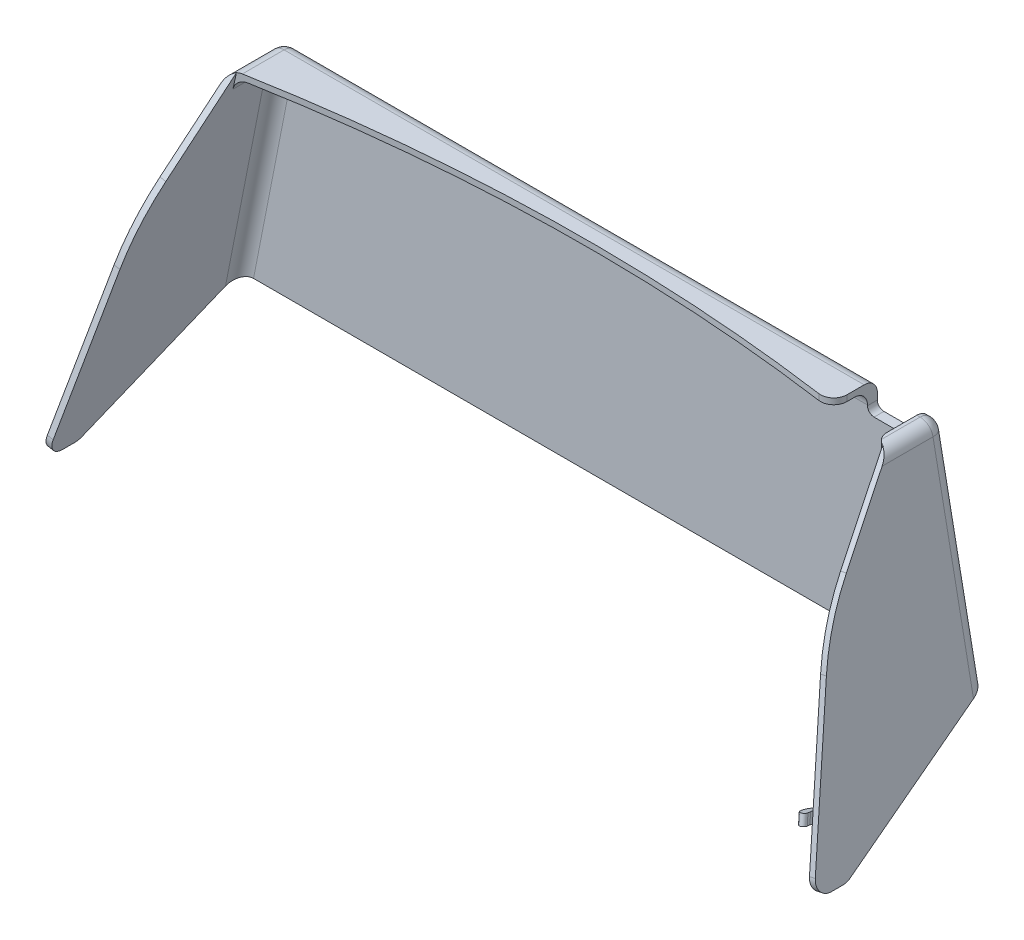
ISO-10303-21;
HEADER;
FILE_DESCRIPTION(('STEP AP214'),'2;1');
FILE_NAME('part.step','',(''),(''),'','','');
FILE_SCHEMA(('AUTOMOTIVE_DESIGN { 1 0 10303 214 1 1 1 1 }'));
ENDSEC;
DATA;
#1=APPLICATION_CONTEXT('core data for automotive mechanical design processes');
#2=APPLICATION_PROTOCOL_DEFINITION('international standard','automotive_design',2000,#1);
#3=PRODUCT_CONTEXT('',#1,'mechanical');
#4=PRODUCT('Part','Part','',(#3));
#5=PRODUCT_RELATED_PRODUCT_CATEGORY('part','',(#4));
#6=PRODUCT_DEFINITION_FORMATION('','',#4);
#7=PRODUCT_DEFINITION_CONTEXT('part definition',#1,'design');
#8=PRODUCT_DEFINITION('design','',#6,#7);
#9=PRODUCT_DEFINITION_SHAPE('','',#8);
#10=(LENGTH_UNIT() NAMED_UNIT(*) SI_UNIT(.MILLI.,.METRE.));
#11=(NAMED_UNIT(*) PLANE_ANGLE_UNIT() SI_UNIT($,.RADIAN.));
#12=(NAMED_UNIT(*) SI_UNIT($,.STERADIAN.) SOLID_ANGLE_UNIT());
#13=UNCERTAINTY_MEASURE_WITH_UNIT(LENGTH_MEASURE(1.E-05),#10,'distance_accuracy_value','');
#14=(GEOMETRIC_REPRESENTATION_CONTEXT(3) GLOBAL_UNCERTAINTY_ASSIGNED_CONTEXT((#13)) GLOBAL_UNIT_ASSIGNED_CONTEXT((#10,
#11,#12)) REPRESENTATION_CONTEXT('',''));
#15=CARTESIAN_POINT('',(0.,0.,0.));
#16=DIRECTION('',(0.,0.,1.));
#17=DIRECTION('',(1.,0.,0.));
#18=AXIS2_PLACEMENT_3D('',#15,#16,#17);
#19=CARTESIAN_POINT('',(110.665763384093,0.,9.));
#20=DIRECTION('',(0.981334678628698,0.192307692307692,0.));
#21=DIRECTION('',(-0.192307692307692,0.981334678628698,0.));
#22=AXIS2_PLACEMENT_3D('',#19,#20,#21);
#23=PLANE('',#22);
#24=DIRECTION('',(0.0499594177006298,-0.254939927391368,-0.965665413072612));
#25=VECTOR('',#24,1.);
#26=CARTESIAN_POINT('',(112.581384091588,-9.77529816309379,44.5500700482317));
#27=LINE('',#26,#25);
#28=CARTESIAN_POINT('',(112.581384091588,-9.7752981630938,44.5500700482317));
#29=VERTEX_POINT('',#28);
#30=CARTESIAN_POINT('',(112.981059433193,-11.8148175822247,36.8247467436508));
#31=VERTEX_POINT('',#30);
#32=EDGE_CURVE('E404',#29,#31,#27,.T.);
#33=ORIENTED_EDGE('',*,*,#32,.F.);
#34=DIRECTION('',(0.185704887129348,-0.947640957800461,0.259788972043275));
#35=VECTOR('',#34,1.);
#36=CARTESIAN_POINT('',(104.376947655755,32.0914514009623,33.0726009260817));
#37=LINE('',#36,#35);
#38=CARTESIAN_POINT('',(106.536984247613,21.0689135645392,36.0943506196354));
#39=VERTEX_POINT('',#38);
#40=EDGE_CURVE('E870',#39,#29,#37,.T.);
#41=ORIENTED_EDGE('',*,*,#40,.F.);
#42=CARTESIAN_POINT('',(109.534549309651,5.77251792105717,-21.8455741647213));
#43=DIRECTION('',(0.981334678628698,0.192307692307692,0.));
#44=DIRECTION('',(-0.192307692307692,0.981334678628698,0.));
#45=AXIS2_PLACEMENT_3D('',#42,#43,#44);
#46=CIRCLE('',#45,60.);
#47=CARTESIAN_POINT('',(102.590529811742,41.2074350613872,26.0725564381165));
#48=VERTEX_POINT('',#47);
#49=EDGE_CURVE('E898',#39,#48,#46,.F.);
#50=ORIENTED_EDGE('',*,*,#49,.T.);
#51=DIRECTION('',(0.153583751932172,-0.78372872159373,0.601815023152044));
#52=VECTOR('',#51,1.);
#53=CARTESIAN_POINT('',(98.2335975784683,63.4406002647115,9.));
#54=LINE('',#53,#52);
#55=CARTESIAN_POINT('',(98.2335975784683,63.4406002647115,9.));
#56=VERTEX_POINT('',#55);
#57=EDGE_CURVE('E866',#56,#48,#54,.T.);
#58=ORIENTED_EDGE('',*,*,#57,.F.);
#59=DIRECTION('',(-0.192307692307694,0.981334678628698,0.));
#60=VECTOR('',#59,1.);
#61=CARTESIAN_POINT('',(98.1657633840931,63.7867541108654,9.));
#62=LINE('',#61,#60);
#63=CARTESIAN_POINT('',(98.615583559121,61.4913485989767,9.));
#64=VERTEX_POINT('',#63);
#65=EDGE_CURVE('E863',#64,#56,#62,.T.);
#66=ORIENTED_EDGE('',*,*,#65,.F.);
#67=CARTESIAN_POINT('',(99.7077804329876,55.9179331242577,5.15199974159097));
#68=DIRECTION('',(0.981334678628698,0.192307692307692,0.));
#69=DIRECTION('',(0.192307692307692,-0.981334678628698,0.));
#70=AXIS2_PLACEMENT_3D('',#67,#68,#69);
#71=ELLIPSE('',#70,20.8,4.);
#72=CARTESIAN_POINT('',(98.9796095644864,59.6337456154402,9.08516223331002));
#73=VERTEX_POINT('',#72);
#74=EDGE_CURVE('E981',#64,#73,#71,.T.);
#75=ORIENTED_EDGE('',*,*,#74,.T.);
#76=CARTESIAN_POINT('',(0.,564.72078699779,543.716393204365));
#77=DIRECTION('',(0.981334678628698,0.192307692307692,0.));
#78=DIRECTION('',(0.192307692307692,-0.981334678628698,0.));
#79=AXIS2_PLACEMENT_3D('',#76,#77,#78);
#80=ELLIPSE('',#79,2827.3252446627,543.716393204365);
#81=CARTESIAN_POINT('',(99.1516203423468,58.7559848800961,9.11703628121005));
#82=VERTEX_POINT('',#81);
#83=EDGE_CURVE('E932',#73,#82,#80,.F.);
#84=ORIENTED_EDGE('',*,*,#83,.T.);
#85=DIRECTION('',(0.,0.,1.));
#86=VECTOR('',#85,1.);
#87=CARTESIAN_POINT('',(99.1516203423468,58.7559848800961,9.05851814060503));
#88=LINE('',#87,#86);
#89=CARTESIAN_POINT('',(99.1516203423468,58.7559848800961,9.));
#90=VERTEX_POINT('',#89);
#91=EDGE_CURVE('E930',#82,#90,#88,.F.);
#92=ORIENTED_EDGE('',*,*,#91,.T.);
#93=DIRECTION('',(0.,0.,-1.));
#94=VECTOR('',#93,1.);
#95=CARTESIAN_POINT('',(99.1516203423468,58.7559848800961,-5.));
#96=LINE('',#95,#94);
#97=CARTESIAN_POINT('',(99.1516203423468,58.7559848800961,-1.));
#98=VERTEX_POINT('',#97);
#99=EDGE_CURVE('E925',#90,#98,#96,.T.);
#100=ORIENTED_EDGE('',*,*,#99,.T.);
#101=DIRECTION('',(-0.192307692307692,0.981334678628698,0.));
#102=VECTOR('',#101,1.);
#103=CARTESIAN_POINT('',(111.065494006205,-2.03980151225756,-1.));
#104=LINE('',#103,#102);
#105=CARTESIAN_POINT('',(111.50802257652,-4.29799840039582,-1.00000000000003));
#106=VERTEX_POINT('',#105);
#107=EDGE_CURVE('E923',#98,#106,#104,.F.);
#108=ORIENTED_EDGE('',*,*,#107,.T.);
#109=DIRECTION('',(-0.0958958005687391,0.489350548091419,-0.866798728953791));
#110=VECTOR('',#109,1.);
#111=CARTESIAN_POINT('',(115.862153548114,-26.5168689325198,38.356834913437));
#112=LINE('',#111,#110);
#113=CARTESIAN_POINT('',(115.862153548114,-26.5168689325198,38.356834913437));
#114=VERTEX_POINT('',#113);
#115=EDGE_CURVE('E838',#114,#106,#112,.T.);
#116=ORIENTED_EDGE('',*,*,#115,.F.);
#117=CARTESIAN_POINT('',(115.195385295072,-23.1143903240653,40.3514675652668));
#118=DIRECTION('',(0.981334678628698,0.192307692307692,0.));
#119=DIRECTION('',(-0.192307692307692,0.981334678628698,0.));
#120=AXIS2_PLACEMENT_3D('',#117,#118,#119);
#121=CIRCLE('',#120,4.);
#122=CARTESIAN_POINT('',(115.964616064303,-27.0397290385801,40.3514675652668));
#123=VERTEX_POINT('',#122);
#124=EDGE_CURVE('E1068',#123,#114,#121,.T.);
#125=ORIENTED_EDGE('',*,*,#124,.F.);
#126=DIRECTION('',(0.,0.,-1.));
#127=VECTOR('',#126,1.);
#128=CARTESIAN_POINT('',(115.964616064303,-27.0397290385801,44.0646650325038));
#129=LINE('',#128,#127);
#130=CARTESIAN_POINT('',(115.964616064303,-27.0397290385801,44.0646650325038));
#131=VERTEX_POINT('',#130);
#132=EDGE_CURVE('E1071',#131,#123,#129,.T.);
#133=ORIENTED_EDGE('',*,*,#132,.F.);
#134=CARTESIAN_POINT('',(115.195385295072,-23.1143903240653,44.0646650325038));
#135=DIRECTION('',(0.981334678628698,0.192307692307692,0.));
#136=DIRECTION('',(-0.192307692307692,0.981334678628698,0.));
#137=AXIS2_PLACEMENT_3D('',#134,#135,#136);
#138=CIRCLE('',#137,4.);
#139=CARTESIAN_POINT('',(114.99554762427,-22.0946306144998,47.9273266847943));
#140=VERTEX_POINT('',#139);
#141=EDGE_CURVE('E844',#140,#131,#138,.T.);
#142=ORIENTED_EDGE('',*,*,#141,.F.);
#143=CARTESIAN_POINT('',(113.138498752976,-12.6182210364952,45.3294369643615));
#144=VERTEX_POINT('',#143);
#145=EDGE_CURVE('E869',#144,#140,#37,.T.);
#146=ORIENTED_EDGE('',*,*,#145,.F.);
#147=DIRECTION('',(-0.0499594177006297,0.254939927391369,0.965665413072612));
#148=VECTOR('',#147,1.);
#149=CARTESIAN_POINT('',(113.538174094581,-14.6577404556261,37.6041136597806));
#150=LINE('',#149,#148);
#151=CARTESIAN_POINT('',(113.538174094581,-14.6577404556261,37.6041136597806));
#152=VERTEX_POINT('',#151);
#153=EDGE_CURVE('E408',#152,#144,#150,.T.);
#154=ORIENTED_EDGE('',*,*,#153,.F.);
#155=DIRECTION('',(0.185704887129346,-0.947640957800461,0.259788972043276));
#156=VECTOR('',#155,1.);
#157=CARTESIAN_POINT('',(112.981059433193,-11.8148175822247,36.8247467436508));
#158=LINE('',#157,#156);
#159=EDGE_CURVE('E414',#31,#152,#158,.T.);
#160=ORIENTED_EDGE('',*,*,#159,.F.);
#161=EDGE_LOOP('',(#33,#41,#50,#58,#66,#75,#84,#92,#100,#108,#116,#125,#133,#142,#146,#154,#160));
#162=FACE_BOUND('',#161,.T.);
#163=ADVANCED_FACE('F35',(#162),#23,.F.);
#164=CARTESIAN_POINT('',(-100.,63.7867541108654,3.));
#165=DIRECTION('',(0.,-1.,0.));
#166=DIRECTION('',(1.,0.,0.));
#167=AXIS2_PLACEMENT_3D('',#164,#165,#166);
#168=PLANE('',#167);
#169=CARTESIAN_POINT('',(0.,63.7867541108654,543.716393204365));
#170=DIRECTION('',(0.,-1.,0.));
#171=DIRECTION('',(1.,0.,0.));
#172=AXIS2_PLACEMENT_3D('',#169,#170,#171);
#173=CIRCLE('',#172,543.716393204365);
#174=CARTESIAN_POINT('',(-96.7077804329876,63.7867541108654,8.66955278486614));
#175=VERTEX_POINT('',#174);
#176=CARTESIAN_POINT('',(75.1548827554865,63.7867541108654,5.21916959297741));
#177=VERTEX_POINT('',#176);
#178=EDGE_CURVE('E854',#175,#177,#173,.T.);
#179=ORIENTED_EDGE('',*,*,#178,.T.);
#180=CARTESIAN_POINT('',(75.7077804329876,63.7867541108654,1.25756585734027));
#181=DIRECTION('',(0.,-1.,0.));
#182=DIRECTION('',(1.,0.,0.));
#183=AXIS2_PLACEMENT_3D('',#180,#181,#182);
#184=CIRCLE('',#183,4.);
#185=CARTESIAN_POINT('',(79.7077804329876,63.7867541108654,1.25756585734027));
#186=VERTEX_POINT('',#185);
#187=EDGE_CURVE('E1114',#177,#186,#184,.F.);
#188=ORIENTED_EDGE('',*,*,#187,.T.);
#189=DIRECTION('',(0.,0.,-1.));
#190=VECTOR('',#189,1.);
#191=CARTESIAN_POINT('',(79.7077804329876,63.7867541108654,20.));
#192=LINE('',#191,#190);
#193=CARTESIAN_POINT('',(79.7077804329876,63.7867541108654,-4.));
#194=VERTEX_POINT('',#193);
#195=EDGE_CURVE('E435',#186,#194,#192,.T.);
#196=ORIENTED_EDGE('',*,*,#195,.T.);
#197=DIRECTION('',(1.,0.,0.));
#198=VECTOR('',#197,1.);
#199=CARTESIAN_POINT('',(-100.,63.7867541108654,-4.));
#200=LINE('',#199,#198);
#201=CARTESIAN_POINT('',(-96.7077804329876,63.7867541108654,-4.));
#202=VERTEX_POINT('',#201);
#203=EDGE_CURVE('E493',#194,#202,#200,.F.);
#204=ORIENTED_EDGE('',*,*,#203,.T.);
#205=DIRECTION('',(0.,0.,-1.));
#206=VECTOR('',#205,1.);
#207=CARTESIAN_POINT('',(-96.7077804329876,63.7867541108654,3.));
#208=LINE('',#207,#206);
#209=EDGE_CURVE('E494',#202,#175,#208,.F.);
#210=ORIENTED_EDGE('',*,*,#209,.T.);
#211=EDGE_LOOP('',(#179,#188,#196,#204,#210));
#212=FACE_BOUND('',#211,.T.);
#213=ADVANCED_FACE('F633',(#212),#168,.F.);
#214=CARTESIAN_POINT('',(0.,69.9867541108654,543.716393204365));
#215=DIRECTION('',(0.,-1.,0.));
#216=DIRECTION('',(1.,0.,0.));
#217=AXIS2_PLACEMENT_3D('',#214,#215,#216);
#218=CYLINDRICAL_SURFACE('',#217,543.716393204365);
#219=CARTESIAN_POINT('',(0.,61.9867541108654,543.716393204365));
#220=DIRECTION('',(0.,-1.,0.));
#221=DIRECTION('',(1.,0.,0.));
#222=AXIS2_PLACEMENT_3D('',#219,#220,#221);
#223=CIRCLE('',#222,543.716393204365);
#224=CARTESIAN_POINT('',(-95.2262816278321,61.9867541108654,8.40389425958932));
#225=VERTEX_POINT('',#224);
#226=CARTESIAN_POINT('',(75.1548827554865,61.9867541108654,5.21916959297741));
#227=VERTEX_POINT('',#226);
#228=EDGE_CURVE('E847',#225,#227,#223,.T.);
#229=ORIENTED_EDGE('',*,*,#228,.T.);
#230=DIRECTION('',(0.,-1.,0.));
#231=VECTOR('',#230,1.);
#232=CARTESIAN_POINT('',(75.1548827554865,69.9867541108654,5.2191695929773));
#233=LINE('',#232,#231);
#234=EDGE_CURVE('E1110',#227,#177,#233,.F.);
#235=ORIENTED_EDGE('',*,*,#234,.T.);
#236=ORIENTED_EDGE('',*,*,#178,.F.);
#237=CARTESIAN_POINT('',(-96.7077804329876,63.7867541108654,8.66955278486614));
#238=CARTESIAN_POINT('',(-96.8228428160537,63.7867660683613,8.69034949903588));
#239=CARTESIAN_POINT('',(-96.9378988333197,63.7817899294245,8.71118416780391));
#240=CARTESIAN_POINT('',(-97.1672231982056,63.7619444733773,8.75278654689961));
#241=CARTESIAN_POINT('',(-97.2814911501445,63.7470705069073,8.77355422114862));
#242=CARTESIAN_POINT('',(-97.5061885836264,63.7078902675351,8.81446551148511));
#243=CARTESIAN_POINT('',(-97.6166496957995,63.6837695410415,8.83461347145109));
#244=CARTESIAN_POINT('',(-97.8351413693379,63.6262602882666,8.87453464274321));
#245=CARTESIAN_POINT('',(-97.9431732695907,63.5928770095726,8.89430805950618));
#246=CARTESIAN_POINT('',(-98.1294714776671,63.526537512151,8.92846359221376));
#247=CARTESIAN_POINT('',(-98.2084282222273,63.4955602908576,8.94295788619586));
#248=CARTESIAN_POINT('',(-98.3648354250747,63.4283842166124,8.97170479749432));
#249=CARTESIAN_POINT('',(-98.4422707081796,63.3921489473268,8.9859548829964));
#250=CARTESIAN_POINT('',(-98.5185011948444,63.3534459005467,8.99999999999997));
#251=B_SPLINE_CURVE_WITH_KNOTS('',3,(#237,#238,#239,#240,#241,#242,#243,#244,#245,#246,#247,
#248,#249,#250),.UNSPECIFIED.,.F.,.F.,(4,2,2,2,2,2,4),(0.,0.350676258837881,0.701517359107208,
1.04565868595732,1.38960544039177,1.64758015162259,1.90743533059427),.UNSPECIFIED.);
#252=CARTESIAN_POINT('',(-98.5185011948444,63.3534459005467,9.));
#253=VERTEX_POINT('',#252);
#254=EDGE_CURVE('E532',#175,#253,#251,.T.);
#255=ORIENTED_EDGE('',*,*,#254,.T.);
#256=DIRECTION('',(0.,-1.,0.));
#257=VECTOR('',#256,1.);
#258=CARTESIAN_POINT('',(-98.5185011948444,67.9867541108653,9.));
#259=LINE('',#258,#257);
#260=CARTESIAN_POINT('',(-98.5185011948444,61.9867541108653,9.));
#261=VERTEX_POINT('',#260);
#262=EDGE_CURVE('E857',#253,#261,#259,.T.);
#263=ORIENTED_EDGE('',*,*,#262,.T.);
#264=CARTESIAN_POINT('',(0.,564.720786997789,543.716393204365));
#265=DIRECTION('',(-0.981334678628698,0.192307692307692,0.));
#266=DIRECTION('',(-0.192307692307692,-0.981334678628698,0.));
#267=AXIS2_PLACEMENT_3D('',#264,#265,#266);
#268=ELLIPSE('',#267,2827.3252446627,543.716393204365);
#269=CARTESIAN_POINT('',(-99.1516203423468,58.7559848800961,9.11703628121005));
#270=VERTEX_POINT('',#269);
#271=EDGE_CURVE('E945',#270,#261,#268,.F.);
#272=ORIENTED_EDGE('',*,*,#271,.F.);
#273=CARTESIAN_POINT('',(-99.1516203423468,58.7559848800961,9.11703628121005));
#274=CARTESIAN_POINT('',(-99.1301375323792,58.8656713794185,9.11305210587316));
#275=CARTESIAN_POINT('',(-99.1040417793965,58.9744155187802,9.10821327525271));
#276=CARTESIAN_POINT('',(-99.0428833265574,59.1892515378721,9.09687940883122));
#277=CARTESIAN_POINT('',(-99.007821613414,59.2953437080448,9.09038455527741));
#278=CARTESIAN_POINT('',(-98.9290242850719,59.5040295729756,9.07579805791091));
#279=CARTESIAN_POINT('',(-98.8852972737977,59.6066266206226,9.06770799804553));
#280=CARTESIAN_POINT('',(-98.7895142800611,59.8076852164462,9.05000144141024));
#281=CARTESIAN_POINT('',(-98.7374582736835,59.9061467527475,9.04038494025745));
#282=CARTESIAN_POINT('',(-98.5693355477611,60.1943176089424,9.00935628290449));
#283=CARTESIAN_POINT('',(-98.441253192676,60.3769738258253,8.98575367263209));
#284=CARTESIAN_POINT('',(-98.1571205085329,60.7179613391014,8.93352444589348));
#285=CARTESIAN_POINT('',(-98.0010773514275,60.8762988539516,8.90489911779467));
#286=CARTESIAN_POINT('',(-97.6637220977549,61.1661960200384,8.84319018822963));
#287=CARTESIAN_POINT('',(-97.4821652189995,61.2974616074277,8.81006351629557));
#288=CARTESIAN_POINT('',(-97.0999717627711,61.5278070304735,8.74055324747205));
#289=CARTESIAN_POINT('',(-96.8993221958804,61.6268647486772,8.70416743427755));
#290=CARTESIAN_POINT('',(-96.5757293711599,61.7543409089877,8.6456886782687));
#291=CARTESIAN_POINT('',(-96.457214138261,61.7947006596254,8.62431047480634));
#292=CARTESIAN_POINT('',(-96.2169608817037,61.8641469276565,8.58105746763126));
#293=CARTESIAN_POINT('',(-96.0952223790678,61.8932317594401,8.55918259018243));
#294=CARTESIAN_POINT('',(-95.8494891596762,61.9398879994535,8.51511589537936));
#295=CARTESIAN_POINT('',(-95.7254922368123,61.9574474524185,8.49292377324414));
#296=CARTESIAN_POINT('',(-95.4764285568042,61.9808874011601,8.44843789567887));
#297=CARTESIAN_POINT('',(-95.3513618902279,61.9867688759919,8.42614414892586));
#298=CARTESIAN_POINT('',(-95.2262816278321,61.9867541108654,8.40389425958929));
#299=B_SPLINE_CURVE_WITH_KNOTS('',3,(#273,#274,#275,#276,#277,#278,#279,#280,#281,#282,#283,
#284,#285,#286,#287,#288,#289,#290,#291,#292,#293,#294,#295,#296,#297,#298),.UNSPECIFIED.,.F.,
.F.,(4,2,2,2,2,2,2,2,2,2,2,2,4),(0.,0.335410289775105,0.670783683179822,1.00582573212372,
1.34086874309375,2.01044470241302,2.67984916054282,3.35618087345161,4.03297605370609,
4.41354231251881,4.79416544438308,5.17518277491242,5.55616816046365),.UNSPECIFIED.);
#300=EDGE_CURVE('E567',#270,#225,#299,.T.);
#301=ORIENTED_EDGE('',*,*,#300,.T.);
#302=EDGE_LOOP('',(#229,#235,#236,#255,#263,#272,#301));
#303=FACE_BOUND('',#302,.T.);
#304=ADVANCED_FACE('F553',(#303),#218,.F.);
#305=CARTESIAN_POINT('',(0.,59.7867541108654,-4.));
#306=DIRECTION('',(1.,0.,0.));
#307=DIRECTION('',(0.,1.,0.));
#308=AXIS2_PLACEMENT_3D('',#305,#306,#307);
#309=CYLINDRICAL_SURFACE('',#308,4.);
#310=CARTESIAN_POINT('',(79.7077804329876,59.7867541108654,-4.));
#311=DIRECTION('',(-1.,0.,0.));
#312=DIRECTION('',(0.,0.,1.));
#313=AXIS2_PLACEMENT_3D('',#310,#311,#312);
#314=CIRCLE('',#313,4.);
#315=CARTESIAN_POINT('',(79.7077804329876,59.7867541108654,-8.));
#316=VERTEX_POINT('',#315);
#317=EDGE_CURVE('E461',#316,#194,#314,.F.);
#318=ORIENTED_EDGE('',*,*,#317,.F.);
#319=DIRECTION('',(1.,0.,0.));
#320=VECTOR('',#319,1.);
#321=CARTESIAN_POINT('',(0.,59.7867541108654,-8.));
#322=LINE('',#321,#320);
#323=CARTESIAN_POINT('',(-96.7077804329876,59.7867541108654,-8.));
#324=VERTEX_POINT('',#323);
#325=EDGE_CURVE('E508',#324,#316,#322,.T.);
#326=ORIENTED_EDGE('',*,*,#325,.F.);
#327=CARTESIAN_POINT('',(-96.7077804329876,59.7867541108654,-4.));
#328=DIRECTION('',(-1.,0.,0.));
#329=DIRECTION('',(0.,0.,1.));
#330=AXIS2_PLACEMENT_3D('',#327,#328,#329);
#331=CIRCLE('',#330,4.);
#332=EDGE_CURVE('E702',#324,#202,#331,.F.);
#333=ORIENTED_EDGE('',*,*,#332,.T.);
#334=ORIENTED_EDGE('',*,*,#203,.F.);
#335=EDGE_LOOP('',(#318,#326,#333,#334));
#336=FACE_BOUND('',#335,.T.);
#337=ADVANCED_FACE('F692',(#336),#309,.T.);
#338=CARTESIAN_POINT('',(0.,0.,-8.));
#339=DIRECTION('',(0.,0.,1.));
#340=DIRECTION('',(1.,0.,0.));
#341=AXIS2_PLACEMENT_3D('',#338,#339,#340);
#342=PLANE('',#341);
#343=ORIENTED_EDGE('',*,*,#325,.T.);
#344=DIRECTION('',(0.,1.,0.));
#345=VECTOR('',#344,1.);
#346=CARTESIAN_POINT('',(79.7077804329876,57.7867541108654,-8.));
#347=LINE('',#346,#345);
#348=CARTESIAN_POINT('',(79.7077804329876,57.7867541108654,-8.));
#349=VERTEX_POINT('',#348);
#350=EDGE_CURVE('E421',#349,#316,#347,.T.);
#351=ORIENTED_EDGE('',*,*,#350,.F.);
#352=CARTESIAN_POINT('',(81.7077804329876,57.7867541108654,-8.));
#353=DIRECTION('',(0.,0.,-1.));
#354=DIRECTION('',(-1.,0.,0.));
#355=AXIS2_PLACEMENT_3D('',#352,#353,#354);
#356=CIRCLE('',#355,2.00000000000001);
#357=CARTESIAN_POINT('',(81.7077804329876,55.7867541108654,-8.));
#358=VERTEX_POINT('',#357);
#359=EDGE_CURVE('E432',#358,#349,#356,.T.);
#360=ORIENTED_EDGE('',*,*,#359,.F.);
#361=DIRECTION('',(-1.,0.,0.));
#362=VECTOR('',#361,1.);
#363=CARTESIAN_POINT('',(93.7077804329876,55.7867541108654,-8.));
#364=LINE('',#363,#362);
#365=CARTESIAN_POINT('',(93.7077804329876,55.7867541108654,-8.));
#366=VERTEX_POINT('',#365);
#367=EDGE_CURVE('E429',#366,#358,#364,.T.);
#368=ORIENTED_EDGE('',*,*,#367,.F.);
#369=CARTESIAN_POINT('',(93.7077804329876,57.7867541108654,-8.));
#370=DIRECTION('',(0.,0.,-1.));
#371=DIRECTION('',(1.,0.,0.));
#372=AXIS2_PLACEMENT_3D('',#369,#370,#371);
#373=CIRCLE('',#372,1.99999999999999);
#374=CARTESIAN_POINT('',(95.7077804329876,57.7867541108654,-8.));
#375=VERTEX_POINT('',#374);
#376=EDGE_CURVE('E426',#375,#366,#373,.T.);
#377=ORIENTED_EDGE('',*,*,#376,.F.);
#378=DIRECTION('',(0.,-1.,0.));
#379=VECTOR('',#378,1.);
#380=CARTESIAN_POINT('',(95.7077804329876,57.7867541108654,-8.));
#381=LINE('',#380,#379);
#382=CARTESIAN_POINT('',(95.7077804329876,59.7867541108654,-8.));
#383=VERTEX_POINT('',#382);
#384=EDGE_CURVE('E423',#383,#375,#381,.T.);
#385=ORIENTED_EDGE('',*,*,#384,.F.);
#386=CARTESIAN_POINT('',(96.7077804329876,59.7867541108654,-8.));
#387=VERTEX_POINT('',#386);
#388=EDGE_CURVE('E511',#383,#387,#322,.T.);
#389=ORIENTED_EDGE('',*,*,#388,.T.);
#390=DIRECTION('',(0.192307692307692,-0.981334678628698,0.));
#391=VECTOR('',#390,1.);
#392=CARTESIAN_POINT('',(104.414158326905,20.4615675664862,-8.));
#393=LINE('',#392,#391);
#394=CARTESIAN_POINT('',(108.034130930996,1.98906337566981,-8.));
#395=VERTEX_POINT('',#394);
#396=EDGE_CURVE('E505',#387,#395,#393,.T.);
#397=ORIENTED_EDGE('',*,*,#396,.T.);
#398=DIRECTION('',(-1.,0.,0.));
#399=VECTOR('',#398,1.);
#400=CARTESIAN_POINT('',(0.,1.98906337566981,-8.));
#401=LINE('',#400,#399);
#402=CARTESIAN_POINT('',(-108.034130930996,1.9890633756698,-8.));
#403=VERTEX_POINT('',#402);
#404=EDGE_CURVE('E514',#395,#403,#401,.T.);
#405=ORIENTED_EDGE('',*,*,#404,.T.);
#406=DIRECTION('',(0.192307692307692,0.981334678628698,0.));
#407=VECTOR('',#406,1.);
#408=CARTESIAN_POINT('',(-104.414158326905,20.4615675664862,-8.));
#409=LINE('',#408,#407);
#410=EDGE_CURVE('E512',#403,#324,#409,.T.);
#411=ORIENTED_EDGE('',*,*,#410,.T.);
#412=EDGE_LOOP('',(#343,#351,#360,#368,#377,#385,#389,#397,#405,#411));
#413=FACE_BOUND('',#412,.T.);
#414=ADVANCED_FACE('F653',(#413),#342,.F.);
#415=CARTESIAN_POINT('',(-110.665763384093,0.,9.));
#416=DIRECTION('',(-0.981334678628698,0.192307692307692,0.));
#417=DIRECTION('',(-0.192307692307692,-0.981334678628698,0.));
#418=AXIS2_PLACEMENT_3D('',#415,#416,#417);
#419=PLANE('',#418);
#420=DIRECTION('',(0.,0.,1.));
#421=VECTOR('',#420,1.);
#422=CARTESIAN_POINT('',(-99.1516203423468,58.7559848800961,9.05851814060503));
#423=LINE('',#422,#421);
#424=CARTESIAN_POINT('',(-99.1516203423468,58.7559848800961,9.));
#425=VERTEX_POINT('',#424);
#426=EDGE_CURVE('E943',#425,#270,#423,.T.);
#427=ORIENTED_EDGE('',*,*,#426,.T.);
#428=ORIENTED_EDGE('',*,*,#271,.T.);
#429=DIRECTION('',(-0.192307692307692,-0.981334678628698,0.));
#430=VECTOR('',#429,1.);
#431=CARTESIAN_POINT('',(-98.5185011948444,61.9867541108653,9.));
#432=LINE('',#431,#430);
#433=CARTESIAN_POINT('',(-98.2335975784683,63.4406002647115,9.));
#434=VERTEX_POINT('',#433);
#435=EDGE_CURVE('E860',#434,#261,#432,.T.);
#436=ORIENTED_EDGE('',*,*,#435,.F.);
#437=DIRECTION('',(0.153583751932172,0.78372872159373,-0.601815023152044));
#438=VECTOR('',#437,1.);
#439=CARTESIAN_POINT('',(-98.2335975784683,63.4406002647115,9.));
#440=LINE('',#439,#438);
#441=CARTESIAN_POINT('',(-102.590529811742,41.2074350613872,26.0725564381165));
#442=VERTEX_POINT('',#441);
#443=EDGE_CURVE('E881',#442,#434,#440,.T.);
#444=ORIENTED_EDGE('',*,*,#443,.F.);
#445=CARTESIAN_POINT('',(-109.534549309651,5.77251792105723,-21.8455741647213));
#446=DIRECTION('',(-0.981334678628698,0.192307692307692,0.));
#447=DIRECTION('',(-0.192307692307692,-0.981334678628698,0.));
#448=AXIS2_PLACEMENT_3D('',#445,#446,#447);
#449=CIRCLE('',#448,60.);
#450=CARTESIAN_POINT('',(-106.536984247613,21.0689135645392,36.0943506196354));
#451=VERTEX_POINT('',#450);
#452=EDGE_CURVE('E516',#442,#451,#449,.F.);
#453=ORIENTED_EDGE('',*,*,#452,.T.);
#454=DIRECTION('',(0.185704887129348,0.947640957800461,-0.259788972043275));
#455=VECTOR('',#454,1.);
#456=CARTESIAN_POINT('',(-104.376947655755,32.0914514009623,33.0726009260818));
#457=LINE('',#456,#455);
#458=CARTESIAN_POINT('',(-114.99554762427,-22.0946306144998,47.9273266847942));
#459=VERTEX_POINT('',#458);
#460=EDGE_CURVE('E878',#459,#451,#457,.T.);
#461=ORIENTED_EDGE('',*,*,#460,.F.);
#462=CARTESIAN_POINT('',(-115.195385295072,-23.1143903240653,44.0646650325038));
#463=DIRECTION('',(-0.981334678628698,0.192307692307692,0.));
#464=DIRECTION('',(0.192307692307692,0.981334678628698,0.));
#465=AXIS2_PLACEMENT_3D('',#462,#463,#464);
#466=CIRCLE('',#465,4.);
#467=CARTESIAN_POINT('',(-115.964616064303,-27.0397290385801,44.0646650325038));
#468=VERTEX_POINT('',#467);
#469=EDGE_CURVE('E1080',#468,#459,#466,.T.);
#470=ORIENTED_EDGE('',*,*,#469,.F.);
#471=DIRECTION('',(0.,0.,1.));
#472=VECTOR('',#471,1.);
#473=CARTESIAN_POINT('',(-115.964616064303,-27.0397290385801,44.0646650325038));
#474=LINE('',#473,#472);
#475=CARTESIAN_POINT('',(-115.964616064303,-27.0397290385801,40.3514675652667));
#476=VERTEX_POINT('',#475);
#477=EDGE_CURVE('E1092',#476,#468,#474,.T.);
#478=ORIENTED_EDGE('',*,*,#477,.F.);
#479=CARTESIAN_POINT('',(-115.195385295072,-23.1143903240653,40.3514675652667));
#480=DIRECTION('',(-0.981334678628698,0.192307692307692,0.));
#481=DIRECTION('',(0.192307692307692,0.981334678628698,0.));
#482=AXIS2_PLACEMENT_3D('',#479,#480,#481);
#483=CIRCLE('',#482,4.00000000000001);
#484=CARTESIAN_POINT('',(-115.862153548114,-26.5168689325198,38.3568349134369));
#485=VERTEX_POINT('',#484);
#486=EDGE_CURVE('E474',#485,#476,#483,.T.);
#487=ORIENTED_EDGE('',*,*,#486,.F.);
#488=DIRECTION('',(-0.0958958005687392,-0.489350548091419,0.866798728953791));
#489=VECTOR('',#488,1.);
#490=CARTESIAN_POINT('',(-115.862153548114,-26.5168689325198,38.3568349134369));
#491=LINE('',#490,#489);
#492=CARTESIAN_POINT('',(-111.50802257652,-4.29799840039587,-0.999999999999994));
#493=VERTEX_POINT('',#492);
#494=EDGE_CURVE('E478',#493,#485,#491,.T.);
#495=ORIENTED_EDGE('',*,*,#494,.F.);
#496=DIRECTION('',(-0.192307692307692,-0.981334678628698,0.));
#497=VECTOR('',#496,1.);
#498=CARTESIAN_POINT('',(-98.5185011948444,61.9867541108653,-1.));
#499=LINE('',#498,#497);
#500=CARTESIAN_POINT('',(-99.1516203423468,58.7559848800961,-1.));
#501=VERTEX_POINT('',#500);
#502=EDGE_CURVE('E939',#493,#501,#499,.F.);
#503=ORIENTED_EDGE('',*,*,#502,.T.);
#504=DIRECTION('',(0.,0.,-1.));
#505=VECTOR('',#504,1.);
#506=CARTESIAN_POINT('',(-99.1516203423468,58.7559848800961,9.));
#507=LINE('',#506,#505);
#508=EDGE_CURVE('E941',#501,#425,#507,.F.);
#509=ORIENTED_EDGE('',*,*,#508,.T.);
#510=EDGE_LOOP('',(#427,#428,#436,#444,#453,#461,#470,#478,#487,#495,#503,#509));
#511=FACE_BOUND('',#510,.T.);
#512=ADVANCED_FACE('F649',(#511),#419,.F.);
#513=CARTESIAN_POINT('',(100.,63.7867541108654,3.));
#514=DIRECTION('',(-0.981334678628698,-0.192307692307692,0.));
#515=DIRECTION('',(0.192307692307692,-0.981334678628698,0.));
#516=AXIS2_PLACEMENT_3D('',#513,#514,#515);
#517=PLANE('',#516);
#518=DIRECTION('',(-0.0958958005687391,0.489350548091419,-0.866798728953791));
#519=VECTOR('',#518,1.);
#520=CARTESIAN_POINT('',(117.628555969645,-26.170715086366,38.356834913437));
#521=LINE('',#520,#519);
#522=CARTESIAN_POINT('',(117.628555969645,-26.170715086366,38.356834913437));
#523=VERTEX_POINT('',#522);
#524=CARTESIAN_POINT('',(112.942528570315,-2.25819688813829,-4.00000000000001));
#525=VERTEX_POINT('',#524);
#526=EDGE_CURVE('E842',#523,#525,#521,.T.);
#527=ORIENTED_EDGE('',*,*,#526,.T.);
#528=DIRECTION('',(0.192307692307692,-0.981334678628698,0.));
#529=VECTOR('',#528,1.);
#530=CARTESIAN_POINT('',(100.,63.7867541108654,-4.));
#531=LINE('',#530,#529);
#532=CARTESIAN_POINT('',(100.633119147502,60.5559848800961,-4.));
#533=VERTEX_POINT('',#532);
#534=EDGE_CURVE('E496',#525,#533,#531,.F.);
#535=ORIENTED_EDGE('',*,*,#534,.T.);
#536=DIRECTION('',(0.,0.,-1.));
#537=VECTOR('',#536,1.);
#538=CARTESIAN_POINT('',(100.633119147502,60.5559848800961,3.));
#539=LINE('',#538,#537);
#540=CARTESIAN_POINT('',(100.633119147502,60.5559848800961,11.4808653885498));
#541=VERTEX_POINT('',#540);
#542=EDGE_CURVE('E499',#533,#541,#539,.F.);
#543=ORIENTED_EDGE('',*,*,#542,.T.);
#544=DIRECTION('',(0.153583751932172,-0.78372872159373,0.601815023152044));
#545=VECTOR('',#544,1.);
#546=CARTESIAN_POINT('',(100.,63.7867541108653,9.));
#547=LINE('',#546,#545);
#548=CARTESIAN_POINT('',(104.356932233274,41.553588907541,26.0725564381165));
#549=VERTEX_POINT('',#548);
#550=EDGE_CURVE('E865',#541,#549,#547,.T.);
#551=ORIENTED_EDGE('',*,*,#550,.T.);
#552=CARTESIAN_POINT('',(111.300951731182,6.11867176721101,-21.8455741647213));
#553=DIRECTION('',(-0.981334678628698,-0.192307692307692,0.));
#554=DIRECTION('',(0.192307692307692,-0.981334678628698,0.));
#555=AXIS2_PLACEMENT_3D('',#552,#553,#554);
#556=CIRCLE('',#555,60.);
#557=CARTESIAN_POINT('',(108.303386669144,21.415067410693,36.0943506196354));
#558=VERTEX_POINT('',#557);
#559=EDGE_CURVE('E894',#549,#558,#556,.F.);
#560=ORIENTED_EDGE('',*,*,#559,.T.);
#561=DIRECTION('',(0.185704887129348,-0.947640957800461,0.259788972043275));
#562=VECTOR('',#561,1.);
#563=CARTESIAN_POINT('',(106.143350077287,32.4376052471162,33.0726009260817));
#564=LINE('',#563,#562);
#565=CARTESIAN_POINT('',(116.761950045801,-21.7484767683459,47.9273266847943));
#566=VERTEX_POINT('',#565);
#567=EDGE_CURVE('E829',#558,#566,#564,.T.);
#568=ORIENTED_EDGE('',*,*,#567,.T.);
#569=CARTESIAN_POINT('',(116.961787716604,-22.7682364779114,44.0646650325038));
#570=DIRECTION('',(0.981334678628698,0.192307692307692,0.));
#571=DIRECTION('',(-0.192307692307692,0.981334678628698,0.));
#572=AXIS2_PLACEMENT_3D('',#569,#570,#571);
#573=CIRCLE('',#572,4.);
#574=CARTESIAN_POINT('',(117.731018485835,-26.6935751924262,44.0646650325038));
#575=VERTEX_POINT('',#574);
#576=EDGE_CURVE('E824',#566,#575,#573,.T.);
#577=ORIENTED_EDGE('',*,*,#576,.T.);
#578=DIRECTION('',(0.,0.,-1.));
#579=VECTOR('',#578,1.);
#580=CARTESIAN_POINT('',(117.731018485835,-26.6935751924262,44.0646650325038));
#581=LINE('',#580,#579);
#582=CARTESIAN_POINT('',(117.731018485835,-26.6935751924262,40.3514675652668));
#583=VERTEX_POINT('',#582);
#584=EDGE_CURVE('E815',#575,#583,#581,.T.);
#585=ORIENTED_EDGE('',*,*,#584,.T.);
#586=CARTESIAN_POINT('',(116.961787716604,-22.7682364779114,40.3514675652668));
#587=DIRECTION('',(0.981334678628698,0.192307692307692,0.));
#588=DIRECTION('',(-0.192307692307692,0.981334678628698,0.));
#589=AXIS2_PLACEMENT_3D('',#586,#587,#588);
#590=CIRCLE('',#589,4.);
#591=EDGE_CURVE('E823',#583,#523,#590,.T.);
#592=ORIENTED_EDGE('',*,*,#591,.T.);
#593=EDGE_LOOP('',(#527,#535,#543,#551,#560,#568,#577,#585,#592));
#594=FACE_BOUND('',#593,.T.);
#595=ADVANCED_FACE('F652',(#594),#517,.F.);
#596=DIRECTION('',(0.,0.,-1.));
#597=VECTOR('',#596,1.);
#598=CARTESIAN_POINT('',(95.7077804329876,63.7867541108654,20.));
#599=LINE('',#598,#597);
#600=CARTESIAN_POINT('',(95.7077804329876,63.7867541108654,5.15199974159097));
#601=VERTEX_POINT('',#600);
#602=CARTESIAN_POINT('',(95.7077804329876,63.7867541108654,-4.));
#603=VERTEX_POINT('',#602);
#604=EDGE_CURVE('E445',#601,#603,#599,.T.);
#605=ORIENTED_EDGE('',*,*,#604,.F.);
#606=CARTESIAN_POINT('',(99.7077804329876,63.7867541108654,5.15199974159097));
#607=DIRECTION('',(0.,-1.,0.));
#608=DIRECTION('',(1.,0.,0.));
#609=AXIS2_PLACEMENT_3D('',#606,#607,#608);
#610=CIRCLE('',#609,4.);
#611=CARTESIAN_POINT('',(96.7077804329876,63.7867541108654,7.79775105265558));
#612=VERTEX_POINT('',#611);
#613=EDGE_CURVE('E614',#601,#612,#610,.F.);
#614=ORIENTED_EDGE('',*,*,#613,.T.);
#615=DIRECTION('',(0.,0.,-1.));
#616=VECTOR('',#615,1.);
#617=CARTESIAN_POINT('',(96.7077804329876,63.7867541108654,3.));
#618=LINE('',#617,#616);
#619=CARTESIAN_POINT('',(96.7077804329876,63.7867541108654,-4.));
#620=VERTEX_POINT('',#619);
#621=EDGE_CURVE('E488',#612,#620,#618,.T.);
#622=ORIENTED_EDGE('',*,*,#621,.T.);
#623=EDGE_CURVE('E490',#620,#603,#200,.F.);
#624=ORIENTED_EDGE('',*,*,#623,.T.);
#625=EDGE_LOOP('',(#605,#614,#622,#624));
#626=FACE_BOUND('',#625,.T.);
#627=ADVANCED_FACE('F643',(#626),#168,.F.);
#628=CARTESIAN_POINT('',(-112.5,0.,3.));
#629=DIRECTION('',(0.981334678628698,-0.192307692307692,0.));
#630=DIRECTION('',(0.192307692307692,0.981334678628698,0.));
#631=AXIS2_PLACEMENT_3D('',#628,#629,#630);
#632=PLANE('',#631);
#633=DIRECTION('',(0.,0.,-1.));
#634=VECTOR('',#633,1.);
#635=CARTESIAN_POINT('',(-100.633119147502,60.5559848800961,3.));
#636=LINE('',#635,#634);
#637=CARTESIAN_POINT('',(-100.633119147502,60.5559848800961,11.4808653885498));
#638=VERTEX_POINT('',#637);
#639=CARTESIAN_POINT('',(-100.633119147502,60.5559848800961,-4.));
#640=VERTEX_POINT('',#639);
#641=EDGE_CURVE('E486',#638,#640,#636,.T.);
#642=ORIENTED_EDGE('',*,*,#641,.T.);
#643=DIRECTION('',(0.192307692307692,0.981334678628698,0.));
#644=VECTOR('',#643,1.);
#645=CARTESIAN_POINT('',(-112.5,0.,-4.));
#646=LINE('',#645,#644);
#647=CARTESIAN_POINT('',(-112.942528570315,-2.2581968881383,-4.));
#648=VERTEX_POINT('',#647);
#649=EDGE_CURVE('E483',#640,#648,#646,.F.);
#650=ORIENTED_EDGE('',*,*,#649,.T.);
#651=DIRECTION('',(-0.0958958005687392,-0.489350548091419,0.866798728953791));
#652=VECTOR('',#651,1.);
#653=CARTESIAN_POINT('',(-117.628555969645,-26.170715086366,38.3568349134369));
#654=LINE('',#653,#652);
#655=CARTESIAN_POINT('',(-117.628555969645,-26.170715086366,38.3568349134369));
#656=VERTEX_POINT('',#655);
#657=EDGE_CURVE('E524',#648,#656,#654,.T.);
#658=ORIENTED_EDGE('',*,*,#657,.T.);
#659=CARTESIAN_POINT('',(-116.961787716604,-22.7682364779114,40.3514675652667));
#660=DIRECTION('',(-0.981334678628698,0.192307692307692,0.));
#661=DIRECTION('',(0.192307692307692,0.981334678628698,0.));
#662=AXIS2_PLACEMENT_3D('',#659,#660,#661);
#663=CIRCLE('',#662,4.00000000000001);
#664=CARTESIAN_POINT('',(-117.731018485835,-26.6935751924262,40.3514675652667));
#665=VERTEX_POINT('',#664);
#666=EDGE_CURVE('E1088',#656,#665,#663,.T.);
#667=ORIENTED_EDGE('',*,*,#666,.T.);
#668=DIRECTION('',(0.,0.,1.));
#669=VECTOR('',#668,1.);
#670=CARTESIAN_POINT('',(-117.731018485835,-26.6935751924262,44.0646650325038));
#671=LINE('',#670,#669);
#672=CARTESIAN_POINT('',(-117.731018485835,-26.6935751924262,44.0646650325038));
#673=VERTEX_POINT('',#672);
#674=EDGE_CURVE('E1085',#665,#673,#671,.T.);
#675=ORIENTED_EDGE('',*,*,#674,.T.);
#676=CARTESIAN_POINT('',(-116.961787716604,-22.7682364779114,44.0646650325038));
#677=DIRECTION('',(-0.981334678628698,0.192307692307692,0.));
#678=DIRECTION('',(0.192307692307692,0.981334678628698,0.));
#679=AXIS2_PLACEMENT_3D('',#676,#677,#678);
#680=CIRCLE('',#679,4.);
#681=CARTESIAN_POINT('',(-116.761950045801,-21.7484767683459,47.9273266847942));
#682=VERTEX_POINT('',#681);
#683=EDGE_CURVE('E1083',#673,#682,#680,.T.);
#684=ORIENTED_EDGE('',*,*,#683,.T.);
#685=DIRECTION('',(0.185704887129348,0.947640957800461,-0.259788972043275));
#686=VECTOR('',#685,1.);
#687=CARTESIAN_POINT('',(-106.143350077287,32.4376052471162,33.0726009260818));
#688=LINE('',#687,#686);
#689=CARTESIAN_POINT('',(-108.303386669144,21.4150674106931,36.0943506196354));
#690=VERTEX_POINT('',#689);
#691=EDGE_CURVE('E877',#682,#690,#688,.T.);
#692=ORIENTED_EDGE('',*,*,#691,.T.);
#693=CARTESIAN_POINT('',(-111.300951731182,6.11867176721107,-21.8455741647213));
#694=DIRECTION('',(0.981334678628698,-0.192307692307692,0.));
#695=DIRECTION('',(0.192307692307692,0.981334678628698,0.));
#696=AXIS2_PLACEMENT_3D('',#693,#694,#695);
#697=CIRCLE('',#696,60.);
#698=CARTESIAN_POINT('',(-104.356932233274,41.5535889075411,26.0725564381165));
#699=VERTEX_POINT('',#698);
#700=EDGE_CURVE('E903',#690,#699,#697,.F.);
#701=ORIENTED_EDGE('',*,*,#700,.T.);
#702=DIRECTION('',(0.153583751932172,0.78372872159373,-0.601815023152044));
#703=VECTOR('',#702,1.);
#704=CARTESIAN_POINT('',(-100.,63.7867541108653,9.));
#705=LINE('',#704,#703);
#706=EDGE_CURVE('E882',#699,#638,#705,.T.);
#707=ORIENTED_EDGE('',*,*,#706,.T.);
#708=EDGE_LOOP('',(#642,#650,#658,#667,#675,#684,#692,#701,#707));
#709=FACE_BOUND('',#708,.T.);
#710=ADVANCED_FACE('F655',(#709),#632,.F.);
#711=CARTESIAN_POINT('',(-98.2335975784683,63.4406002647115,9.));
#712=DIRECTION('',(0.11573365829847,0.590581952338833,0.798635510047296));
#713=DIRECTION('',(0.,-0.804038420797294,0.594577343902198));
#714=AXIS2_PLACEMENT_3D('',#711,#712,#713);
#715=PLANE('',#714);
#716=DIRECTION('',(-0.981334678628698,0.192307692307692,0.));
#717=VECTOR('',#716,1.);
#718=CARTESIAN_POINT('',(-98.2335975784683,63.4406002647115,9.));
#719=LINE('',#718,#717);
#720=CARTESIAN_POINT('',(-98.304103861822,63.4544170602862,9.));
#721=VERTEX_POINT('',#720);
#722=EDGE_CURVE('E884',#434,#721,#719,.T.);
#723=ORIENTED_EDGE('',*,*,#722,.T.);
#724=CARTESIAN_POINT('',(-96.7077804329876,59.7867541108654,11.4808653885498));
#725=DIRECTION('',(0.11573365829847,0.590581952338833,0.798635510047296));
#726=DIRECTION('',(0.153583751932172,0.78372872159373,-0.601815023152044));
#727=AXIS2_PLACEMENT_3D('',#724,#725,#726);
#728=ELLIPSE('',#727,5.00854263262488,4.);
#729=EDGE_CURVE('E920',#721,#638,#728,.T.);
#730=ORIENTED_EDGE('',*,*,#729,.T.);
#731=ORIENTED_EDGE('',*,*,#706,.F.);
#732=DIRECTION('',(-0.981334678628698,0.192307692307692,0.));
#733=VECTOR('',#732,1.);
#734=CARTESIAN_POINT('',(-102.590529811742,41.2074350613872,26.0725564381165));
#735=LINE('',#734,#733);
#736=EDGE_CURVE('E904',#699,#442,#735,.F.);
#737=ORIENTED_EDGE('',*,*,#736,.T.);
#738=ORIENTED_EDGE('',*,*,#443,.T.);
#739=EDGE_LOOP('',(#723,#730,#731,#737,#738));
#740=FACE_BOUND('',#739,.T.);
#741=ADVANCED_FACE('F657',(#740),#715,.T.);
#742=CARTESIAN_POINT('',(-104.376947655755,32.0914514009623,33.0726009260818));
#743=DIRECTION('',(0.0499594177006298,0.254939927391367,0.965665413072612));
#744=DIRECTION('',(0.,-0.966872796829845,0.255258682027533));
#745=AXIS2_PLACEMENT_3D('',#742,#743,#744);
#746=PLANE('',#745);
#747=ORIENTED_EDGE('',*,*,#460,.T.);
#748=DIRECTION('',(-0.981334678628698,0.192307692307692,0.));
#749=VECTOR('',#748,1.);
#750=CARTESIAN_POINT('',(-106.536984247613,21.0689135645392,36.0943506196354));
#751=LINE('',#750,#749);
#752=EDGE_CURVE('E900',#451,#690,#751,.T.);
#753=ORIENTED_EDGE('',*,*,#752,.T.);
#754=ORIENTED_EDGE('',*,*,#691,.F.);
#755=DIRECTION('',(-0.981334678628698,0.192307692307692,0.));
#756=VECTOR('',#755,1.);
#757=CARTESIAN_POINT('',(-114.99554762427,-22.0946306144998,47.9273266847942));
#758=LINE('',#757,#756);
#759=EDGE_CURVE('E832',#459,#682,#758,.T.);
#760=ORIENTED_EDGE('',*,*,#759,.F.);
#761=EDGE_LOOP('',(#747,#753,#754,#760));
#762=FACE_BOUND('',#761,.T.);
#763=ADVANCED_FACE('F647',(#762),#746,.T.);
#764=CARTESIAN_POINT('',(104.376947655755,32.0914514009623,33.0726009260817));
#765=DIRECTION('',(-0.0499594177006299,0.254939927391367,0.965665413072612));
#766=DIRECTION('',(0.,-0.966872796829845,0.255258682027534));
#767=AXIS2_PLACEMENT_3D('',#764,#765,#766);
#768=PLANE('',#767);
#769=DIRECTION('',(0.185704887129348,-0.94764095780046,0.259788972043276));
#770=VECTOR('',#769,1.);
#771=CARTESIAN_POINT('',(112.0242694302,-6.93237528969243,43.7707031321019));
#772=LINE('',#771,#770);
#773=EDGE_CURVE('E394',#29,#144,#772,.T.);
#774=ORIENTED_EDGE('',*,*,#773,.T.);
#775=ORIENTED_EDGE('',*,*,#145,.T.);
#776=DIRECTION('',(0.981334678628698,0.192307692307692,0.));
#777=VECTOR('',#776,1.);
#778=CARTESIAN_POINT('',(114.99554762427,-22.0946306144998,47.9273266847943));
#779=LINE('',#778,#777);
#780=EDGE_CURVE('E850',#140,#566,#779,.T.);
#781=ORIENTED_EDGE('',*,*,#780,.T.);
#782=ORIENTED_EDGE('',*,*,#567,.F.);
#783=DIRECTION('',(0.981334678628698,0.192307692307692,0.));
#784=VECTOR('',#783,1.);
#785=CARTESIAN_POINT('',(106.536984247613,21.0689135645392,36.0943506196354));
#786=LINE('',#785,#784);
#787=EDGE_CURVE('E896',#558,#39,#786,.F.);
#788=ORIENTED_EDGE('',*,*,#787,.T.);
#789=ORIENTED_EDGE('',*,*,#40,.T.);
#790=EDGE_LOOP('',(#774,#775,#781,#782,#788,#789));
#791=FACE_BOUND('',#790,.T.);
#792=ADVANCED_FACE('F1137',(#791),#768,.T.);
#793=CARTESIAN_POINT('',(98.2335975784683,63.4406002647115,9.));
#794=DIRECTION('',(-0.11573365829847,0.590581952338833,0.798635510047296));
#795=DIRECTION('',(0.,-0.804038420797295,0.594577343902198));
#796=AXIS2_PLACEMENT_3D('',#793,#794,#795);
#797=PLANE('',#796);
#798=ORIENTED_EDGE('',*,*,#550,.F.);
#799=CARTESIAN_POINT('',(96.7077804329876,59.7867541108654,11.4808653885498));
#800=DIRECTION('',(-0.11573365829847,0.590581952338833,0.798635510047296));
#801=DIRECTION('',(-0.153583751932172,0.78372872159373,-0.601815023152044));
#802=AXIS2_PLACEMENT_3D('',#799,#800,#801);
#803=ELLIPSE('',#802,5.00854263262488,4.);
#804=CARTESIAN_POINT('',(98.3041038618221,63.4544170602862,9.));
#805=VERTEX_POINT('',#804);
#806=EDGE_CURVE('E528',#541,#805,#803,.T.);
#807=ORIENTED_EDGE('',*,*,#806,.T.);
#808=DIRECTION('',(0.981334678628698,0.192307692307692,0.));
#809=VECTOR('',#808,1.);
#810=CARTESIAN_POINT('',(98.2335975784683,63.4406002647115,9.));
#811=LINE('',#810,#809);
#812=EDGE_CURVE('E872',#56,#805,#811,.T.);
#813=ORIENTED_EDGE('',*,*,#812,.F.);
#814=ORIENTED_EDGE('',*,*,#57,.T.);
#815=DIRECTION('',(0.981334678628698,0.192307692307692,0.));
#816=VECTOR('',#815,1.);
#817=CARTESIAN_POINT('',(102.590529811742,41.2074350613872,26.0725564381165));
#818=LINE('',#817,#816);
#819=EDGE_CURVE('E891',#48,#549,#818,.T.);
#820=ORIENTED_EDGE('',*,*,#819,.T.);
#821=EDGE_LOOP('',(#798,#807,#813,#814,#820));
#822=FACE_BOUND('',#821,.T.);
#823=ADVANCED_FACE('F1139',(#822),#797,.T.);
#824=CARTESIAN_POINT('',(98.5185011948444,61.9867541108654,9.));
#825=DIRECTION('',(0.,1.,0.));
#826=DIRECTION('',(-1.,0.,0.));
#827=AXIS2_PLACEMENT_3D('',#824,#825,#826);
#828=PLANE('',#827);
#829=DIRECTION('',(0.,0.,1.));
#830=VECTOR('',#829,1.);
#831=CARTESIAN_POINT('',(79.7077804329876,61.9867541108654,9.));
#832=LINE('',#831,#830);
#833=CARTESIAN_POINT('',(79.7077804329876,61.9867541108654,-1.));
#834=VERTEX_POINT('',#833);
#835=CARTESIAN_POINT('',(79.7077804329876,61.9867541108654,1.25756585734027));
#836=VERTEX_POINT('',#835);
#837=EDGE_CURVE('E458',#834,#836,#832,.T.);
#838=ORIENTED_EDGE('',*,*,#837,.T.);
#839=CARTESIAN_POINT('',(75.7077804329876,61.9867541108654,1.25756585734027));
#840=DIRECTION('',(0.,1.,0.));
#841=DIRECTION('',(-1.,0.,0.));
#842=AXIS2_PLACEMENT_3D('',#839,#840,#841);
#843=CIRCLE('',#842,4.);
#844=EDGE_CURVE('E991',#836,#227,#843,.F.);
#845=ORIENTED_EDGE('',*,*,#844,.T.);
#846=ORIENTED_EDGE('',*,*,#228,.F.);
#847=DIRECTION('',(0.,0.,-1.));
#848=VECTOR('',#847,1.);
#849=CARTESIAN_POINT('',(-95.2262816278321,61.9867541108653,-5.));
#850=LINE('',#849,#848);
#851=CARTESIAN_POINT('',(-95.2262816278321,61.9867541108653,-1.));
#852=VERTEX_POINT('',#851);
#853=EDGE_CURVE('E937',#225,#852,#850,.T.);
#854=ORIENTED_EDGE('',*,*,#853,.T.);
#855=DIRECTION('',(-1.,0.,0.));
#856=VECTOR('',#855,1.);
#857=CARTESIAN_POINT('',(98.5185011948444,61.9867541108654,-1.));
#858=LINE('',#857,#856);
#859=EDGE_CURVE('E934',#852,#834,#858,.F.);
#860=ORIENTED_EDGE('',*,*,#859,.T.);
#861=EDGE_LOOP('',(#838,#845,#846,#854,#860));
#862=FACE_BOUND('',#861,.T.);
#863=ADVANCED_FACE('F1119',(#862),#828,.F.);
#864=CARTESIAN_POINT('',(-98.5185011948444,67.9867541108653,9.));
#865=DIRECTION('',(0.,0.,1.));
#866=DIRECTION('',(1.,0.,0.));
#867=AXIS2_PLACEMENT_3D('',#864,#865,#866);
#868=PLANE('',#867);
#869=ORIENTED_EDGE('',*,*,#262,.F.);
#870=CARTESIAN_POINT('',(-96.7077804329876,59.7867541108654,9.));
#871=DIRECTION('',(0.,0.,1.));
#872=DIRECTION('',(1.,0.,0.));
#873=AXIS2_PLACEMENT_3D('',#870,#871,#872);
#874=CIRCLE('',#873,4.);
#875=EDGE_CURVE('E539',#253,#721,#874,.F.);
#876=ORIENTED_EDGE('',*,*,#875,.T.);
#877=ORIENTED_EDGE('',*,*,#722,.F.);
#878=ORIENTED_EDGE('',*,*,#435,.T.);
#879=EDGE_LOOP('',(#869,#876,#877,#878));
#880=FACE_BOUND('',#879,.T.);
#881=ADVANCED_FACE('F1484',(#880),#868,.F.);
#882=ORIENTED_EDGE('',*,*,#812,.T.);
#883=CARTESIAN_POINT('',(96.7077804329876,59.7867541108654,9.));
#884=DIRECTION('',(0.,0.,1.));
#885=DIRECTION('',(1.,0.,0.));
#886=AXIS2_PLACEMENT_3D('',#883,#884,#885);
#887=CIRCLE('',#886,4.);
#888=CARTESIAN_POINT('',(98.6155835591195,63.3024741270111,9.));
#889=VERTEX_POINT('',#888);
#890=EDGE_CURVE('E530',#805,#889,#887,.F.);
#891=ORIENTED_EDGE('',*,*,#890,.T.);
#892=DIRECTION('',(0.,-1.,0.));
#893=VECTOR('',#892,1.);
#894=CARTESIAN_POINT('',(98.6155835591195,63.3024741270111,9.));
#895=LINE('',#894,#893);
#896=EDGE_CURVE('E986',#889,#64,#895,.T.);
#897=ORIENTED_EDGE('',*,*,#896,.T.);
#898=ORIENTED_EDGE('',*,*,#65,.T.);
#899=EDGE_LOOP('',(#882,#891,#897,#898));
#900=FACE_BOUND('',#899,.T.);
#901=ADVANCED_FACE('F669',(#900),#868,.F.);
#902=CARTESIAN_POINT('',(109.534549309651,5.77251792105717,-21.8455741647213));
#903=DIRECTION('',(0.981334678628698,0.192307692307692,0.));
#904=DIRECTION('',(-0.192307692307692,0.981334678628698,0.));
#905=AXIS2_PLACEMENT_3D('',#902,#903,#904);
#906=CYLINDRICAL_SURFACE('',#905,60.);
#907=ORIENTED_EDGE('',*,*,#49,.F.);
#908=ORIENTED_EDGE('',*,*,#787,.F.);
#909=ORIENTED_EDGE('',*,*,#559,.F.);
#910=ORIENTED_EDGE('',*,*,#819,.F.);
#911=EDGE_LOOP('',(#907,#908,#909,#910));
#912=FACE_BOUND('',#911,.T.);
#913=ADVANCED_FACE('F665',(#912),#906,.T.);
#914=CARTESIAN_POINT('',(-109.534549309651,5.77251792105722,-21.8455741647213));
#915=DIRECTION('',(-0.981334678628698,0.192307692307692,0.));
#916=DIRECTION('',(-0.192307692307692,-0.981334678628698,0.));
#917=AXIS2_PLACEMENT_3D('',#914,#915,#916);
#918=CYLINDRICAL_SURFACE('',#917,60.);
#919=ORIENTED_EDGE('',*,*,#452,.F.);
#920=ORIENTED_EDGE('',*,*,#736,.F.);
#921=ORIENTED_EDGE('',*,*,#700,.F.);
#922=ORIENTED_EDGE('',*,*,#752,.F.);
#923=EDGE_LOOP('',(#919,#920,#921,#922));
#924=FACE_BOUND('',#923,.T.);
#925=ADVANCED_FACE('F668',(#924),#918,.T.);
#926=CARTESIAN_POINT('',(0.,0.,-5.));
#927=DIRECTION('',(0.,0.,-1.));
#928=DIRECTION('',(-1.,0.,0.));
#929=AXIS2_PLACEMENT_3D('',#926,#927,#928);
#930=PLANE('',#929);
#931=CARTESIAN_POINT('',(81.7077804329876,57.7867541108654,-5.));
#932=DIRECTION('',(0.,0.,-1.));
#933=DIRECTION('',(-1.,0.,0.));
#934=AXIS2_PLACEMENT_3D('',#931,#932,#933);
#935=CIRCLE('',#934,2.00000000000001);
#936=CARTESIAN_POINT('',(81.7077804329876,55.7867541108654,-5.));
#937=VERTEX_POINT('',#936);
#938=CARTESIAN_POINT('',(79.7077804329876,57.7867541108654,-5.));
#939=VERTEX_POINT('',#938);
#940=EDGE_CURVE('E973',#937,#939,#935,.T.);
#941=ORIENTED_EDGE('',*,*,#940,.T.);
#942=DIRECTION('',(0.,1.,0.));
#943=VECTOR('',#942,1.);
#944=CARTESIAN_POINT('',(79.7077804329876,0.,-5.));
#945=LINE('',#944,#943);
#946=CARTESIAN_POINT('',(79.7077804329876,57.9867541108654,-5.));
#947=VERTEX_POINT('',#946);
#948=EDGE_CURVE('E455',#939,#947,#945,.T.);
#949=ORIENTED_EDGE('',*,*,#948,.T.);
#950=DIRECTION('',(-1.,0.,0.));
#951=VECTOR('',#950,1.);
#952=CARTESIAN_POINT('',(-98.5185011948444,57.9867541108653,-5.));
#953=LINE('',#952,#951);
#954=CARTESIAN_POINT('',(-95.226281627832,57.9867541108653,-5.));
#955=VERTEX_POINT('',#954);
#956=EDGE_CURVE('E948',#947,#955,#953,.T.);
#957=ORIENTED_EDGE('',*,*,#956,.T.);
#958=DIRECTION('',(-0.192307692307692,-0.981334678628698,0.));
#959=VECTOR('',#958,1.);
#960=CARTESIAN_POINT('',(-107.14015529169,-2.80903228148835,-5.));
#961=LINE('',#960,#959);
#962=CARTESIAN_POINT('',(-106.989412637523,-2.03980151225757,-5.));
#963=VERTEX_POINT('',#962);
#964=EDGE_CURVE('E947',#955,#963,#961,.T.);
#965=ORIENTED_EDGE('',*,*,#964,.T.);
#966=DIRECTION('',(-1.,0.,0.));
#967=VECTOR('',#966,1.);
#968=CARTESIAN_POINT('',(110.266032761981,-2.03980151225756,-5.));
#969=LINE('',#968,#967);
#970=CARTESIAN_POINT('',(106.989412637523,-2.03980151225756,-5.));
#971=VERTEX_POINT('',#970);
#972=EDGE_CURVE('E470',#971,#963,#969,.T.);
#973=ORIENTED_EDGE('',*,*,#972,.F.);
#974=DIRECTION('',(-0.192307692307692,0.981334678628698,0.));
#975=VECTOR('',#974,1.);
#976=CARTESIAN_POINT('',(94.5931624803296,61.2175233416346,-5.));
#977=LINE('',#976,#975);
#978=CARTESIAN_POINT('',(95.4558866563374,56.8150933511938,-5.));
#979=VERTEX_POINT('',#978);
#980=EDGE_CURVE('E568',#971,#979,#977,.T.);
#981=ORIENTED_EDGE('',*,*,#980,.T.);
#982=CARTESIAN_POINT('',(93.7077804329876,57.7867541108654,-5.));
#983=DIRECTION('',(0.,0.,-1.));
#984=DIRECTION('',(-1.,0.,0.));
#985=AXIS2_PLACEMENT_3D('',#982,#983,#984);
#986=CIRCLE('',#985,1.99999999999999);
#987=CARTESIAN_POINT('',(93.7077804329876,55.7867541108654,-5.));
#988=VERTEX_POINT('',#987);
#989=EDGE_CURVE('E464',#979,#988,#986,.T.);
#990=ORIENTED_EDGE('',*,*,#989,.T.);
#991=DIRECTION('',(-1.,0.,0.));
#992=VECTOR('',#991,1.);
#993=CARTESIAN_POINT('',(0.,55.7867541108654,-5.));
#994=LINE('',#993,#992);
#995=EDGE_CURVE('E762',#988,#937,#994,.T.);
#996=ORIENTED_EDGE('',*,*,#995,.T.);
#997=EDGE_LOOP('',(#941,#949,#957,#965,#973,#981,#990,#996));
#998=FACE_BOUND('',#997,.T.);
#999=ADVANCED_FACE('F551',(#998),#930,.F.);
#1000=ORIENTED_EDGE('',*,*,#83,.F.);
#1001=DIRECTION('',(0.,-1.,0.));
#1002=VECTOR('',#1001,1.);
#1003=CARTESIAN_POINT('',(98.9796095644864,69.9867541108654,9.08516223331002));
#1004=LINE('',#1003,#1002);
#1005=CARTESIAN_POINT('',(98.9796095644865,59.3696964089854,9.08516223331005));
#1006=VERTEX_POINT('',#1005);
#1007=EDGE_CURVE('E593',#73,#1006,#1004,.T.);
#1008=ORIENTED_EDGE('',*,*,#1007,.T.);
#1009=CARTESIAN_POINT('',(95.226281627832,61.9867541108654,8.40389425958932));
#1010=CARTESIAN_POINT('',(95.3401610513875,61.9867652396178,8.42415179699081));
#1011=CARTESIAN_POINT('',(95.4540324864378,61.9818913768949,8.44444614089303));
#1012=CARTESIAN_POINT('',(95.6809563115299,61.9624571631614,8.48496287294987));
#1013=CARTESIAN_POINT('',(95.7940087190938,61.9478970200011,8.50518526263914));
#1014=CARTESIAN_POINT('',(96.018500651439,61.9091729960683,8.54541416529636));
#1015=CARTESIAN_POINT('',(96.1299401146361,61.8850087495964,8.56542067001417));
#1016=CARTESIAN_POINT('',(96.3504087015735,61.8272387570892,8.60507065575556));
#1017=CARTESIAN_POINT('',(96.4594378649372,61.7936331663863,8.62471414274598));
#1018=CARTESIAN_POINT('',(96.6743482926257,61.7171851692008,8.66349997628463));
#1019=CARTESIAN_POINT('',(96.7802283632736,61.6743393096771,8.68264213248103));
#1020=CARTESIAN_POINT('',(96.9880693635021,61.5796843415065,8.72027938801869));
#1021=CARTESIAN_POINT('',(97.0900289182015,61.5278721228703,8.73877426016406));
#1022=CARTESIAN_POINT('',(97.2891789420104,61.4156764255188,8.77495515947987));
#1023=CARTESIAN_POINT('',(97.3863724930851,61.3552985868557,8.79264170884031));
#1024=CARTESIAN_POINT('',(97.5753413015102,61.2263532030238,8.82707920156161));
#1025=CARTESIAN_POINT('',(97.6671166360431,61.1577857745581,8.84383015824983));
#1026=CARTESIAN_POINT('',(97.8439871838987,61.0133968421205,8.87615683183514));
#1027=CARTESIAN_POINT('',(97.9291216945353,60.9376250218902,8.8917394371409));
#1028=CARTESIAN_POINT('',(98.0926903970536,60.7790066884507,8.92171555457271));
#1029=CARTESIAN_POINT('',(98.1711270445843,60.6961627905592,8.93610950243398));
#1030=CARTESIAN_POINT('',(98.3207816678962,60.5238972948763,8.96360365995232));
#1031=CARTESIAN_POINT('',(98.3919949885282,60.4344715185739,8.97670303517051));
#1032=CARTESIAN_POINT('',(98.5265633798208,60.2497592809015,9.00148109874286));
#1033=CARTESIAN_POINT('',(98.5899214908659,60.154475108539,9.01316033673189));
#1034=CARTESIAN_POINT('',(98.7093723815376,59.9569412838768,9.03519865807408));
#1035=CARTESIAN_POINT('',(98.7653143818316,59.8545973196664,9.04553029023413));
#1036=CARTESIAN_POINT('',(98.8681025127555,59.6452887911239,9.06452771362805));
#1037=CARTESIAN_POINT('',(98.9149485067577,59.5383241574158,9.07319347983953));
#1038=CARTESIAN_POINT('',(98.999199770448,59.3204481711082,9.08878772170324));
#1039=CARTESIAN_POINT('',(99.0365921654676,59.2095316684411,9.0957138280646));
#1040=CARTESIAN_POINT('',(99.1015529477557,58.9847492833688,9.10775180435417));
#1041=CARTESIAN_POINT('',(99.129120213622,58.8708830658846,9.11286346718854));
#1042=CARTESIAN_POINT('',(99.1516203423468,58.7559848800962,9.11703628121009));
#1043=B_SPLINE_CURVE_WITH_KNOTS('',3,(#1009,#1010,#1011,#1012,#1013,#1014,#1015,#1016,#1017,
#1018,#1019,#1020,#1021,#1022,#1023,#1024,#1025,#1026,#1027,#1028,#1029,#1030,#1031,#1032,#1033,
#1034,#1035,#1036,#1037,#1038,#1039,#1040,#1041,#1042),.UNSPECIFIED.,.F.,.F.,(4,2,2,2,2,2,2,2,2,
2,2,2,2,2,2,2,4),(0.,0.346896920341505,0.693786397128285,1.0406890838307,1.38758606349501,
1.73461290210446,2.08176034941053,2.42868026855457,2.77559524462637,3.12027081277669,
3.46481946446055,3.80958877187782,4.15422421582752,4.50504414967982,4.85586935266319,
5.20716979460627,5.55851031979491),.UNSPECIFIED.);
#1044=EDGE_CURVE('E561',#1006,#82,#1043,.T.);
#1045=ORIENTED_EDGE('',*,*,#1044,.T.);
#1046=EDGE_LOOP('',(#1000,#1008,#1045));
#1047=FACE_BOUND('',#1046,.T.);
#1048=ADVANCED_FACE('F545',(#1047),#218,.F.);
#1049=CARTESIAN_POINT('',(115.862153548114,-26.5168689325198,38.356834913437));
#1050=DIRECTION('',(0.166692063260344,-0.850619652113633,-0.498658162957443));
#1051=DIRECTION('',(0.,0.505733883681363,-0.862689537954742));
#1052=AXIS2_PLACEMENT_3D('',#1049,#1050,#1051);
#1053=PLANE('',#1052);
#1054=CARTESIAN_POINT('',(134.616044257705,1.98906337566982,-4.));
#1055=DIRECTION('',(0.166692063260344,-0.850619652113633,-0.498658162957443));
#1056=DIRECTION('',(-0.986009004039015,-0.143803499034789,-0.0843018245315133));
#1057=AXIS2_PLACEMENT_3D('',#1054,#1055,#1056);
#1058=ELLIPSE('',#1057,23.9963434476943,4.);
#1059=CARTESIAN_POINT('',(110.958571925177,-1.49418451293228,-5.96646488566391));
#1060=VERTEX_POINT('',#1059);
#1061=CARTESIAN_POINT('',(111.564650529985,-0.916748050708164,-6.74886521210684));
#1062=VERTEX_POINT('',#1061);
#1063=EDGE_CURVE('E503',#1060,#1062,#1058,.T.);
#1064=ORIENTED_EDGE('',*,*,#1063,.T.);
#1065=CARTESIAN_POINT('',(109.0171898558,-3.02742765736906,-4.));
#1066=DIRECTION('',(0.166692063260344,-0.850619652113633,-0.498658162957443));
#1067=DIRECTION('',(0.095895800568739,-0.489350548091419,0.866798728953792));
#1068=AXIS2_PLACEMENT_3D('',#1065,#1066,#1067);
#1069=ELLIPSE('',#1068,4.61468143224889,4.);
#1070=EDGE_CURVE('E501',#1062,#525,#1069,.T.);
#1071=ORIENTED_EDGE('',*,*,#1070,.T.);
#1072=ORIENTED_EDGE('',*,*,#526,.F.);
#1073=DIRECTION('',(0.981334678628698,0.192307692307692,0.));
#1074=VECTOR('',#1073,1.);
#1075=CARTESIAN_POINT('',(115.862153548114,-26.5168689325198,38.356834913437));
#1076=LINE('',#1075,#1074);
#1077=EDGE_CURVE('E845',#114,#523,#1076,.T.);
#1078=ORIENTED_EDGE('',*,*,#1077,.F.);
#1079=ORIENTED_EDGE('',*,*,#115,.T.);
#1080=DIRECTION('',(0.0958958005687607,-0.489350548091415,0.866798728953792));
#1081=VECTOR('',#1080,1.);
#1082=CARTESIAN_POINT('',(115.862153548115,-26.5168689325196,38.356834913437));
#1083=LINE('',#1082,#1081);
#1084=EDGE_CURVE('E468',#1060,#106,#1083,.T.);
#1085=ORIENTED_EDGE('',*,*,#1084,.F.);
#1086=EDGE_LOOP('',(#1064,#1071,#1072,#1078,#1079,#1085));
#1087=FACE_BOUND('',#1086,.T.);
#1088=ADVANCED_FACE('F550',(#1087),#1053,.T.);
#1089=CARTESIAN_POINT('',(115.195385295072,-23.1143903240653,40.3514675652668));
#1090=DIRECTION('',(0.981334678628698,0.192307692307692,0.));
#1091=DIRECTION('',(-0.192307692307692,0.981334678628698,0.));
#1092=AXIS2_PLACEMENT_3D('',#1089,#1090,#1091);
#1093=CYLINDRICAL_SURFACE('',#1092,4.);
#1094=ORIENTED_EDGE('',*,*,#591,.F.);
#1095=DIRECTION('',(0.981334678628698,0.192307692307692,0.));
#1096=VECTOR('',#1095,1.);
#1097=CARTESIAN_POINT('',(115.964616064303,-27.0397290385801,40.3514675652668));
#1098=LINE('',#1097,#1096);
#1099=EDGE_CURVE('E820',#123,#583,#1098,.T.);
#1100=ORIENTED_EDGE('',*,*,#1099,.F.);
#1101=ORIENTED_EDGE('',*,*,#124,.T.);
#1102=ORIENTED_EDGE('',*,*,#1077,.T.);
#1103=EDGE_LOOP('',(#1094,#1100,#1101,#1102));
#1104=FACE_BOUND('',#1103,.T.);
#1105=ADVANCED_FACE('F802',(#1104),#1093,.T.);
#1106=CARTESIAN_POINT('',(115.964616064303,-27.0397290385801,44.0646650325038));
#1107=DIRECTION('',(0.192307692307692,-0.981334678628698,0.));
#1108=DIRECTION('',(0.981334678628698,0.192307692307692,0.));
#1109=AXIS2_PLACEMENT_3D('',#1106,#1107,#1108);
#1110=PLANE('',#1109);
#1111=ORIENTED_EDGE('',*,*,#584,.F.);
#1112=DIRECTION('',(0.981334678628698,0.192307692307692,0.));
#1113=VECTOR('',#1112,1.);
#1114=CARTESIAN_POINT('',(115.964616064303,-27.0397290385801,44.0646650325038));
#1115=LINE('',#1114,#1113);
#1116=EDGE_CURVE('E818',#131,#575,#1115,.T.);
#1117=ORIENTED_EDGE('',*,*,#1116,.F.);
#1118=ORIENTED_EDGE('',*,*,#132,.T.);
#1119=ORIENTED_EDGE('',*,*,#1099,.T.);
#1120=EDGE_LOOP('',(#1111,#1117,#1118,#1119));
#1121=FACE_BOUND('',#1120,.T.);
#1122=ADVANCED_FACE('F805',(#1121),#1110,.T.);
#1123=CARTESIAN_POINT('',(115.195385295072,-23.1143903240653,44.0646650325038));
#1124=DIRECTION('',(0.981334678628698,0.192307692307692,0.));
#1125=DIRECTION('',(-0.192307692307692,0.981334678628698,0.));
#1126=AXIS2_PLACEMENT_3D('',#1123,#1124,#1125);
#1127=CYLINDRICAL_SURFACE('',#1126,4.);
#1128=ORIENTED_EDGE('',*,*,#576,.F.);
#1129=ORIENTED_EDGE('',*,*,#780,.F.);
#1130=ORIENTED_EDGE('',*,*,#141,.T.);
#1131=ORIENTED_EDGE('',*,*,#1116,.T.);
#1132=EDGE_LOOP('',(#1128,#1129,#1130,#1131));
#1133=FACE_BOUND('',#1132,.T.);
#1134=ADVANCED_FACE('F554',(#1133),#1127,.T.);
#1135=CARTESIAN_POINT('',(-115.195385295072,-23.1143903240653,44.0646650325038));
#1136=DIRECTION('',(-0.981334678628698,0.192307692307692,0.));
#1137=DIRECTION('',(-0.192307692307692,-0.981334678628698,0.));
#1138=AXIS2_PLACEMENT_3D('',#1135,#1136,#1137);
#1139=CYLINDRICAL_SURFACE('',#1138,4.);
#1140=ORIENTED_EDGE('',*,*,#683,.F.);
#1141=DIRECTION('',(-0.981334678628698,0.192307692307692,0.));
#1142=VECTOR('',#1141,1.);
#1143=CARTESIAN_POINT('',(-115.964616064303,-27.0397290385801,44.0646650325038));
#1144=LINE('',#1143,#1142);
#1145=EDGE_CURVE('E835',#468,#673,#1144,.T.);
#1146=ORIENTED_EDGE('',*,*,#1145,.F.);
#1147=ORIENTED_EDGE('',*,*,#469,.T.);
#1148=ORIENTED_EDGE('',*,*,#759,.T.);
#1149=EDGE_LOOP('',(#1140,#1146,#1147,#1148));
#1150=FACE_BOUND('',#1149,.T.);
#1151=ADVANCED_FACE('F785',(#1150),#1139,.T.);
#1152=CARTESIAN_POINT('',(-115.964616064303,-27.0397290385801,44.0646650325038));
#1153=DIRECTION('',(-0.192307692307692,-0.981334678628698,0.));
#1154=DIRECTION('',(0.981334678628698,-0.192307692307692,0.));
#1155=AXIS2_PLACEMENT_3D('',#1152,#1153,#1154);
#1156=PLANE('',#1155);
#1157=ORIENTED_EDGE('',*,*,#674,.F.);
#1158=DIRECTION('',(-0.981334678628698,0.192307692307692,0.));
#1159=VECTOR('',#1158,1.);
#1160=CARTESIAN_POINT('',(-115.964616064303,-27.0397290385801,40.3514675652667));
#1161=LINE('',#1160,#1159);
#1162=EDGE_CURVE('E1079',#476,#665,#1161,.T.);
#1163=ORIENTED_EDGE('',*,*,#1162,.F.);
#1164=ORIENTED_EDGE('',*,*,#477,.T.);
#1165=ORIENTED_EDGE('',*,*,#1145,.T.);
#1166=EDGE_LOOP('',(#1157,#1163,#1164,#1165));
#1167=FACE_BOUND('',#1166,.T.);
#1168=ADVANCED_FACE('F788',(#1167),#1156,.T.);
#1169=CARTESIAN_POINT('',(-115.195385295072,-23.1143903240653,40.3514675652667));
#1170=DIRECTION('',(-0.981334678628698,0.192307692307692,0.));
#1171=DIRECTION('',(-0.192307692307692,-0.981334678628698,0.));
#1172=AXIS2_PLACEMENT_3D('',#1169,#1170,#1171);
#1173=CYLINDRICAL_SURFACE('',#1172,4.00000000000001);
#1174=ORIENTED_EDGE('',*,*,#666,.F.);
#1175=DIRECTION('',(-0.981334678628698,0.192307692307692,0.));
#1176=VECTOR('',#1175,1.);
#1177=CARTESIAN_POINT('',(-115.862153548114,-26.5168689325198,38.3568349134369));
#1178=LINE('',#1177,#1176);
#1179=EDGE_CURVE('E1076',#485,#656,#1178,.T.);
#1180=ORIENTED_EDGE('',*,*,#1179,.F.);
#1181=ORIENTED_EDGE('',*,*,#486,.T.);
#1182=ORIENTED_EDGE('',*,*,#1162,.T.);
#1183=EDGE_LOOP('',(#1174,#1180,#1181,#1182));
#1184=FACE_BOUND('',#1183,.T.);
#1185=ADVANCED_FACE('F792',(#1184),#1173,.T.);
#1186=CARTESIAN_POINT('',(-115.862153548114,-26.5168689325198,38.3568349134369));
#1187=DIRECTION('',(-0.166692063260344,-0.850619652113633,-0.498658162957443));
#1188=DIRECTION('',(0.,0.505733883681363,-0.862689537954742));
#1189=AXIS2_PLACEMENT_3D('',#1186,#1187,#1188);
#1190=PLANE('',#1189);
#1191=ORIENTED_EDGE('',*,*,#657,.F.);
#1192=CARTESIAN_POINT('',(-109.0171898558,-3.02742765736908,-4.));
#1193=DIRECTION('',(-0.166692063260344,-0.850619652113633,-0.498658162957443));
#1194=DIRECTION('',(0.0958958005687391,0.489350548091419,-0.866798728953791));
#1195=AXIS2_PLACEMENT_3D('',#1192,#1193,#1194);
#1196=ELLIPSE('',#1195,4.61468143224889,4.);
#1197=CARTESIAN_POINT('',(-111.564650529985,-0.916748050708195,-6.74886521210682));
#1198=VERTEX_POINT('',#1197);
#1199=EDGE_CURVE('E525',#648,#1198,#1196,.T.);
#1200=ORIENTED_EDGE('',*,*,#1199,.T.);
#1201=CARTESIAN_POINT('',(-134.616044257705,1.9890633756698,-4.));
#1202=DIRECTION('',(-0.166692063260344,-0.850619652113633,-0.498658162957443));
#1203=DIRECTION('',(-0.986009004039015,0.143803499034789,0.0843018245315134));
#1204=AXIS2_PLACEMENT_3D('',#1201,#1202,#1203);
#1205=ELLIPSE('',#1204,23.9963434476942,4.);
#1206=CARTESIAN_POINT('',(-110.958571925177,-1.49418451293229,-5.96646488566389));
#1207=VERTEX_POINT('',#1206);
#1208=EDGE_CURVE('E485',#1198,#1207,#1205,.T.);
#1209=ORIENTED_EDGE('',*,*,#1208,.T.);
#1210=EDGE_CURVE('E481',#1207,#493,#491,.T.);
#1211=ORIENTED_EDGE('',*,*,#1210,.T.);
#1212=ORIENTED_EDGE('',*,*,#494,.T.);
#1213=ORIENTED_EDGE('',*,*,#1179,.T.);
#1214=EDGE_LOOP('',(#1191,#1200,#1209,#1211,#1212,#1213));
#1215=FACE_BOUND('',#1214,.T.);
#1216=ADVANCED_FACE('F783',(#1215),#1190,.T.);
#1217=CARTESIAN_POINT('',(110.266032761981,-2.03980151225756,-5.));
#1218=DIRECTION('',(0.,0.870811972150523,0.491616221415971));
#1219=DIRECTION('',(0.,-0.491616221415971,0.870811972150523));
#1220=AXIS2_PLACEMENT_3D('',#1217,#1218,#1219);
#1221=PLANE('',#1220);
#1222=ORIENTED_EDGE('',*,*,#1210,.F.);
#1223=DIRECTION('',(-1.,0.,0.));
#1224=VECTOR('',#1223,1.);
#1225=CARTESIAN_POINT('',(110.266032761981,-1.49418451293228,-5.96646488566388));
#1226=LINE('',#1225,#1224);
#1227=EDGE_CURVE('E526',#1207,#1060,#1226,.F.);
#1228=ORIENTED_EDGE('',*,*,#1227,.T.);
#1229=ORIENTED_EDGE('',*,*,#1084,.T.);
#1230=CARTESIAN_POINT('',(107.431941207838,-4.29799840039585,-1.));
#1231=DIRECTION('',(0.,0.870811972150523,0.491616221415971));
#1232=DIRECTION('',(0.37028106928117,-0.45667202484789,0.808914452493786));
#1233=AXIS2_PLACEMENT_3D('',#1230,#1231,#1232);
#1234=ELLIPSE('',#1233,4.68078241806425,4.);
#1235=EDGE_CURVE('E960',#106,#971,#1234,.T.);
#1236=ORIENTED_EDGE('',*,*,#1235,.T.);
#1237=ORIENTED_EDGE('',*,*,#972,.T.);
#1238=CARTESIAN_POINT('',(-107.431941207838,-4.29799840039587,-1.));
#1239=DIRECTION('',(0.,0.870811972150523,0.491616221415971));
#1240=DIRECTION('',(0.37028106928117,0.45667202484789,-0.808914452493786));
#1241=AXIS2_PLACEMENT_3D('',#1238,#1239,#1240);
#1242=ELLIPSE('',#1241,4.68078241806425,4.);
#1243=EDGE_CURVE('E751',#963,#493,#1242,.T.);
#1244=ORIENTED_EDGE('',*,*,#1243,.T.);
#1245=EDGE_LOOP('',(#1222,#1228,#1229,#1236,#1237,#1244));
#1246=FACE_BOUND('',#1245,.T.);
#1247=ADVANCED_FACE('F629',(#1246),#1221,.F.);
#1248=CARTESIAN_POINT('',(-96.7077804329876,59.7867541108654,3.));
#1249=DIRECTION('',(0.,0.,-1.));
#1250=DIRECTION('',(-1.,0.,0.));
#1251=AXIS2_PLACEMENT_3D('',#1248,#1249,#1250);
#1252=CYLINDRICAL_SURFACE('',#1251,4.);
#1253=CARTESIAN_POINT('',(-96.7077804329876,59.7867541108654,-4.));
#1254=DIRECTION('',(0.,0.,-1.));
#1255=DIRECTION('',(-1.,0.,0.));
#1256=AXIS2_PLACEMENT_3D('',#1253,#1254,#1255);
#1257=CIRCLE('',#1256,4.);
#1258=EDGE_CURVE('E471',#640,#202,#1257,.T.);
#1259=ORIENTED_EDGE('',*,*,#1258,.F.);
#1260=ORIENTED_EDGE('',*,*,#641,.F.);
#1261=ORIENTED_EDGE('',*,*,#729,.F.);
#1262=ORIENTED_EDGE('',*,*,#875,.F.);
#1263=ORIENTED_EDGE('',*,*,#254,.F.);
#1264=ORIENTED_EDGE('',*,*,#209,.F.);
#1265=EDGE_LOOP('',(#1259,#1260,#1261,#1262,#1263,#1264));
#1266=FACE_BOUND('',#1265,.T.);
#1267=ADVANCED_FACE('F541',(#1266),#1252,.T.);
#1268=CARTESIAN_POINT('',(-96.7077804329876,59.7867541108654,-4.));
#1269=DIRECTION('',(0.,0.,1.));
#1270=DIRECTION('',(1.,0.,0.));
#1271=AXIS2_PLACEMENT_3D('',#1268,#1269,#1270);
#1272=SPHERICAL_SURFACE('',#1271,4.);
#1273=CARTESIAN_POINT('',(-96.7077804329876,59.7867541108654,-4.));
#1274=DIRECTION('',(0.192307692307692,0.981334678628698,0.));
#1275=DIRECTION('',(-0.981334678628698,0.192307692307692,0.));
#1276=AXIS2_PLACEMENT_3D('',#1273,#1274,#1275);
#1277=CIRCLE('',#1276,4.);
#1278=EDGE_CURVE('E696',#640,#324,#1277,.F.);
#1279=ORIENTED_EDGE('',*,*,#1278,.F.);
#1280=ORIENTED_EDGE('',*,*,#1258,.T.);
#1281=ORIENTED_EDGE('',*,*,#332,.F.);
#1282=EDGE_LOOP('',(#1279,#1280,#1281));
#1283=FACE_BOUND('',#1282,.T.);
#1284=ADVANCED_FACE('F621',(#1283),#1272,.T.);
#1285=CARTESIAN_POINT('',(96.7077804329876,59.7867541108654,3.));
#1286=DIRECTION('',(0.,0.,-1.));
#1287=DIRECTION('',(-1.,0.,0.));
#1288=AXIS2_PLACEMENT_3D('',#1285,#1286,#1287);
#1289=CYLINDRICAL_SURFACE('',#1288,4.);
#1290=CARTESIAN_POINT('',(96.7077804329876,63.7867541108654,7.79775105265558));
#1291=CARTESIAN_POINT('',(96.7675500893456,63.7867563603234,7.86554240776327));
#1292=CARTESIAN_POINT('',(96.8296497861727,63.7854143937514,7.93130763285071));
#1293=CARTESIAN_POINT('',(96.9581157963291,63.7794306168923,8.05845654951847));
#1294=CARTESIAN_POINT('',(97.0244850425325,63.7747865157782,8.11983716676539));
#1295=CARTESIAN_POINT('',(97.161294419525,63.7615580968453,8.23803600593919));
#1296=CARTESIAN_POINT('',(97.2317502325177,63.7529575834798,8.29483433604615));
#1297=CARTESIAN_POINT('',(97.3758828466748,63.7312373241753,8.40321162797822));
#1298=CARTESIAN_POINT('',(97.4495587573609,63.7181188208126,8.4547920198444));
#1299=CARTESIAN_POINT('',(97.5998383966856,63.6867736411,8.55268526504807));
#1300=CARTESIAN_POINT('',(97.6764549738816,63.6685216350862,8.59897035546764));
#1301=CARTESIAN_POINT('',(97.8314487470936,63.6265214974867,8.68573221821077));
#1302=CARTESIAN_POINT('',(97.9098257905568,63.6027738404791,8.72620949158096));
#1303=CARTESIAN_POINT('',(98.0671468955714,63.5495977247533,8.80109335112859));
#1304=CARTESIAN_POINT('',(98.1460876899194,63.5201910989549,8.83552232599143));
#1305=CARTESIAN_POINT('',(98.3038624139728,63.4555115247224,8.89849417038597));
#1306=CARTESIAN_POINT('',(98.3826963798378,63.4202426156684,8.92704106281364));
#1307=CARTESIAN_POINT('',(98.4869057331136,63.3694271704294,8.96122675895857));
#1308=CARTESIAN_POINT('',(98.5127494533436,63.356477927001,8.96941093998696));
#1309=CARTESIAN_POINT('',(98.564284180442,63.3299493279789,8.98516305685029));
#1310=CARTESIAN_POINT('',(98.5899752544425,63.3163702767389,8.99273128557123));
#1311=CARTESIAN_POINT('',(98.6155835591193,63.3024741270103,8.99999999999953));
#1312=B_SPLINE_CURVE_WITH_KNOTS('',3,(#1290,#1291,#1292,#1293,#1294,#1295,#1296,#1297,#1298,
#1299,#1300,#1301,#1302,#1303,#1304,#1305,#1306,#1307,#1308,#1309,#1310,#1311),.UNSPECIFIED.,
.F.,.F.,(4,2,2,2,2,2,2,2,2,2,4),(0.,0.271102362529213,0.542392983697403,0.814804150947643,
1.08714045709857,1.36084483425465,1.63452558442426,1.90717087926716,2.1796290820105,
2.26974757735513,2.35982296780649),.UNSPECIFIED.);
#1313=EDGE_CURVE('E607',#612,#889,#1312,.T.);
#1314=ORIENTED_EDGE('',*,*,#1313,.T.);
#1315=ORIENTED_EDGE('',*,*,#890,.F.);
#1316=ORIENTED_EDGE('',*,*,#806,.F.);
#1317=ORIENTED_EDGE('',*,*,#542,.F.);
#1318=CARTESIAN_POINT('',(96.7077804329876,59.7867541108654,-4.));
#1319=DIRECTION('',(0.,0.,-1.));
#1320=DIRECTION('',(-1.,0.,0.));
#1321=AXIS2_PLACEMENT_3D('',#1318,#1319,#1320);
#1322=CIRCLE('',#1321,4.);
#1323=EDGE_CURVE('E703',#620,#533,#1322,.T.);
#1324=ORIENTED_EDGE('',*,*,#1323,.F.);
#1325=ORIENTED_EDGE('',*,*,#621,.F.);
#1326=EDGE_LOOP('',(#1314,#1315,#1316,#1317,#1324,#1325));
#1327=FACE_BOUND('',#1326,.T.);
#1328=ADVANCED_FACE('F616',(#1327),#1289,.T.);
#1329=CARTESIAN_POINT('',(95.7077804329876,59.7867541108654,-4.));
#1330=DIRECTION('',(1.,0.,0.));
#1331=DIRECTION('',(0.,1.,0.));
#1332=AXIS2_PLACEMENT_3D('',#1329,#1330,#1331);
#1333=CIRCLE('',#1332,4.);
#1334=EDGE_CURVE('E453',#603,#383,#1333,.F.);
#1335=ORIENTED_EDGE('',*,*,#1334,.F.);
#1336=ORIENTED_EDGE('',*,*,#623,.F.);
#1337=CARTESIAN_POINT('',(96.7077804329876,59.7867541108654,-4.));
#1338=DIRECTION('',(1.,0.,0.));
#1339=DIRECTION('',(0.,1.,0.));
#1340=AXIS2_PLACEMENT_3D('',#1337,#1338,#1339);
#1341=CIRCLE('',#1340,4.);
#1342=EDGE_CURVE('E724',#387,#620,#1341,.T.);
#1343=ORIENTED_EDGE('',*,*,#1342,.F.);
#1344=ORIENTED_EDGE('',*,*,#388,.F.);
#1345=EDGE_LOOP('',(#1335,#1336,#1343,#1344));
#1346=FACE_BOUND('',#1345,.T.);
#1347=ADVANCED_FACE('F620',(#1346),#309,.T.);
#1348=CARTESIAN_POINT('',(-104.414158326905,20.4615675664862,-4.));
#1349=DIRECTION('',(0.192307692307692,0.981334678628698,0.));
#1350=DIRECTION('',(-0.981334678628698,0.192307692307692,0.));
#1351=AXIS2_PLACEMENT_3D('',#1348,#1349,#1350);
#1352=CYLINDRICAL_SURFACE('',#1351,4.);
#1353=ORIENTED_EDGE('',*,*,#1278,.T.);
#1354=ORIENTED_EDGE('',*,*,#410,.F.);
#1355=CARTESIAN_POINT('',(-108.034130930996,1.9890633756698,-4.));
#1356=DIRECTION('',(-0.635488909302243,0.772109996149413,0.));
#1357=DIRECTION('',(-0.772109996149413,-0.635488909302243,0.));
#1358=AXIS2_PLACEMENT_3D('',#1355,#1356,#1357);
#1359=ELLIPSE('',#1358,6.29436633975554,4.);
#1360=EDGE_CURVE('E722',#1198,#403,#1359,.F.);
#1361=ORIENTED_EDGE('',*,*,#1360,.F.);
#1362=ORIENTED_EDGE('',*,*,#1199,.F.);
#1363=ORIENTED_EDGE('',*,*,#649,.F.);
#1364=EDGE_LOOP('',(#1353,#1354,#1361,#1362,#1363));
#1365=FACE_BOUND('',#1364,.T.);
#1366=ADVANCED_FACE('F684',(#1365),#1352,.T.);
#1367=CARTESIAN_POINT('',(96.7077804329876,59.7867541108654,-4.));
#1368=DIRECTION('',(0.,0.,1.));
#1369=DIRECTION('',(1.,0.,0.));
#1370=AXIS2_PLACEMENT_3D('',#1367,#1368,#1369);
#1371=SPHERICAL_SURFACE('',#1370,4.);
#1372=ORIENTED_EDGE('',*,*,#1342,.T.);
#1373=ORIENTED_EDGE('',*,*,#1323,.T.);
#1374=CARTESIAN_POINT('',(96.7077804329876,59.7867541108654,-4.));
#1375=DIRECTION('',(-0.192307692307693,0.981334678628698,0.));
#1376=DIRECTION('',(-0.981334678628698,-0.192307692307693,0.));
#1377=AXIS2_PLACEMENT_3D('',#1374,#1375,#1376);
#1378=CIRCLE('',#1377,4.);
#1379=EDGE_CURVE('E725',#387,#533,#1378,.F.);
#1380=ORIENTED_EDGE('',*,*,#1379,.F.);
#1381=EDGE_LOOP('',(#1372,#1373,#1380));
#1382=FACE_BOUND('',#1381,.T.);
#1383=ADVANCED_FACE('F681',(#1382),#1371,.T.);
#1384=CARTESIAN_POINT('',(0.,1.98906337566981,-4.));
#1385=DIRECTION('',(-1.,0.,0.));
#1386=DIRECTION('',(0.,-1.,0.));
#1387=AXIS2_PLACEMENT_3D('',#1384,#1385,#1386);
#1388=CYLINDRICAL_SURFACE('',#1387,4.);
#1389=ORIENTED_EDGE('',*,*,#1360,.T.);
#1390=ORIENTED_EDGE('',*,*,#404,.F.);
#1391=CARTESIAN_POINT('',(108.034130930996,1.98906337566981,-4.));
#1392=DIRECTION('',(-0.635488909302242,-0.772109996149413,0.));
#1393=DIRECTION('',(-0.772109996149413,0.635488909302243,0.));
#1394=AXIS2_PLACEMENT_3D('',#1391,#1392,#1393);
#1395=ELLIPSE('',#1394,6.29436633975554,4.);
#1396=EDGE_CURVE('E719',#1062,#395,#1395,.F.);
#1397=ORIENTED_EDGE('',*,*,#1396,.F.);
#1398=ORIENTED_EDGE('',*,*,#1063,.F.);
#1399=ORIENTED_EDGE('',*,*,#1227,.F.);
#1400=ORIENTED_EDGE('',*,*,#1208,.F.);
#1401=EDGE_LOOP('',(#1389,#1390,#1397,#1398,#1399,#1400));
#1402=FACE_BOUND('',#1401,.T.);
#1403=ADVANCED_FACE('F677',(#1402),#1388,.T.);
#1404=CARTESIAN_POINT('',(104.414158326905,20.4615675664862,-4.));
#1405=DIRECTION('',(0.192307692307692,-0.981334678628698,0.));
#1406=DIRECTION('',(0.981334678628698,0.192307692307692,0.));
#1407=AXIS2_PLACEMENT_3D('',#1404,#1405,#1406);
#1408=CYLINDRICAL_SURFACE('',#1407,4.);
#1409=ORIENTED_EDGE('',*,*,#1379,.T.);
#1410=ORIENTED_EDGE('',*,*,#534,.F.);
#1411=ORIENTED_EDGE('',*,*,#1070,.F.);
#1412=ORIENTED_EDGE('',*,*,#1396,.T.);
#1413=ORIENTED_EDGE('',*,*,#396,.F.);
#1414=EDGE_LOOP('',(#1409,#1410,#1411,#1412,#1413));
#1415=FACE_BOUND('',#1414,.T.);
#1416=ADVANCED_FACE('F674',(#1415),#1408,.T.);
#1417=CARTESIAN_POINT('',(-102.647755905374,20.1154137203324,-1.));
#1418=DIRECTION('',(0.192307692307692,0.981334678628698,0.));
#1419=DIRECTION('',(-0.981334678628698,0.192307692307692,0.));
#1420=AXIS2_PLACEMENT_3D('',#1417,#1418,#1419);
#1421=CYLINDRICAL_SURFACE('',#1420,4.);
#1422=ORIENTED_EDGE('',*,*,#1243,.F.);
#1423=ORIENTED_EDGE('',*,*,#964,.F.);
#1424=CARTESIAN_POINT('',(-95.226281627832,57.9867541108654,-1.));
#1425=DIRECTION('',(-0.192307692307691,-0.981334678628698,0.));
#1426=DIRECTION('',(0.981334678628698,-0.192307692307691,0.));
#1427=AXIS2_PLACEMENT_3D('',#1424,#1425,#1426);
#1428=CIRCLE('',#1427,4.);
#1429=EDGE_CURVE('E745',#501,#955,#1428,.T.);
#1430=ORIENTED_EDGE('',*,*,#1429,.F.);
#1431=ORIENTED_EDGE('',*,*,#502,.F.);
#1432=EDGE_LOOP('',(#1422,#1423,#1430,#1431));
#1433=FACE_BOUND('',#1432,.T.);
#1434=ADVANCED_FACE('F604',(#1433),#1421,.F.);
#1435=CARTESIAN_POINT('',(-95.2262816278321,57.9867541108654,9.));
#1436=DIRECTION('',(0.,0.,1.));
#1437=DIRECTION('',(1.,0.,0.));
#1438=AXIS2_PLACEMENT_3D('',#1435,#1436,#1437);
#1439=CYLINDRICAL_SURFACE('',#1438,4.);
#1440=ORIENTED_EDGE('',*,*,#426,.F.);
#1441=ORIENTED_EDGE('',*,*,#508,.F.);
#1442=CARTESIAN_POINT('',(-95.2262816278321,57.9867541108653,-1.));
#1443=DIRECTION('',(0.,0.,1.));
#1444=DIRECTION('',(1.,0.,0.));
#1445=AXIS2_PLACEMENT_3D('',#1442,#1443,#1444);
#1446=CIRCLE('',#1445,4.);
#1447=EDGE_CURVE('E742',#852,#501,#1446,.T.);
#1448=ORIENTED_EDGE('',*,*,#1447,.F.);
#1449=ORIENTED_EDGE('',*,*,#853,.F.);
#1450=ORIENTED_EDGE('',*,*,#300,.F.);
#1451=EDGE_LOOP('',(#1440,#1441,#1448,#1449,#1450));
#1452=FACE_BOUND('',#1451,.T.);
#1453=ADVANCED_FACE('F1375',(#1452),#1439,.F.);
#1454=CARTESIAN_POINT('',(-95.226281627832,57.9867541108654,-1.));
#1455=DIRECTION('',(0.,0.,1.));
#1456=DIRECTION('',(1.,0.,0.));
#1457=AXIS2_PLACEMENT_3D('',#1454,#1455,#1456);
#1458=SPHERICAL_SURFACE('',#1457,4.);
#1459=ORIENTED_EDGE('',*,*,#1447,.T.);
#1460=ORIENTED_EDGE('',*,*,#1429,.T.);
#1461=CARTESIAN_POINT('',(-95.226281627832,57.9867541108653,-1.));
#1462=DIRECTION('',(1.,0.,0.));
#1463=DIRECTION('',(0.,1.,0.));
#1464=AXIS2_PLACEMENT_3D('',#1461,#1462,#1463);
#1465=CIRCLE('',#1464,4.);
#1466=EDGE_CURVE('E739',#852,#955,#1465,.F.);
#1467=ORIENTED_EDGE('',*,*,#1466,.F.);
#1468=EDGE_LOOP('',(#1459,#1460,#1467));
#1469=FACE_BOUND('',#1468,.T.);
#1470=ADVANCED_FACE('F1054',(#1469),#1458,.F.);
#1471=CARTESIAN_POINT('',(102.647755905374,20.1154137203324,-1.));
#1472=DIRECTION('',(0.192307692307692,-0.981334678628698,0.));
#1473=DIRECTION('',(0.981334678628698,0.192307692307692,0.));
#1474=AXIS2_PLACEMENT_3D('',#1471,#1472,#1473);
#1475=CYLINDRICAL_SURFACE('',#1474,4.);
#1476=CARTESIAN_POINT('',(95.7077804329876,55.5296944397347,-1.));
#1477=DIRECTION('',(1.,0.,0.));
#1478=DIRECTION('',(0.,-1.,0.));
#1479=AXIS2_PLACEMENT_3D('',#1476,#1477,#1478);
#1480=ELLIPSE('',#1479,20.7999999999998,4.);
#1481=CARTESIAN_POINT('',(95.7077804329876,58.0811112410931,-4.96979289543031));
#1482=VERTEX_POINT('',#1481);
#1483=CARTESIAN_POINT('',(95.7077804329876,57.7867541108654,-4.97638034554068));
#1484=VERTEX_POINT('',#1483);
#1485=EDGE_CURVE('E450',#1482,#1484,#1480,.F.);
#1486=ORIENTED_EDGE('',*,*,#1485,.T.);
#1487=CARTESIAN_POINT('',(95.7077804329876,57.7867541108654,-4.97638034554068));
#1488=CARTESIAN_POINT('',(95.7077776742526,57.7300174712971,-4.97756487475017));
#1489=CARTESIAN_POINT('',(95.7053640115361,57.6733224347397,-4.97897525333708));
#1490=CARTESIAN_POINT('',(95.6957330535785,57.5603310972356,-4.98206675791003));
#1491=CARTESIAN_POINT('',(95.6885142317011,57.5040349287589,-4.98374796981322));
#1492=CARTESIAN_POINT('',(95.660101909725,57.3387294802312,-4.98884900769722));
#1493=CARTESIAN_POINT('',(95.6321461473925,57.2307810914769,-4.99239433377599));
#1494=CARTESIAN_POINT('',(95.5767928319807,57.0726040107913,-4.99656479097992));
#1495=CARTESIAN_POINT('',(95.5558424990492,57.0200264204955,-4.99776940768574));
#1496=CARTESIAN_POINT('',(95.5093100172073,56.9162643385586,-4.99949006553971));
#1497=CARTESIAN_POINT('',(95.4836800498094,56.8651011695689,-4.99999848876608));
#1498=CARTESIAN_POINT('',(95.4558866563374,56.8150933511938,-5.));
#1499=B_SPLINE_CURVE_WITH_KNOTS('',3,(#1487,#1488,#1489,#1490,#1491,#1492,#1493,#1494,#1495,
#1496,#1497,#1498),.UNSPECIFIED.,.F.,.F.,(4,2,2,2,2,4),(0.,0.170122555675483,0.340299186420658,
0.673175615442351,0.842836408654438,1.0143392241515),.UNSPECIFIED.);
#1500=EDGE_CURVE('E754',#1484,#979,#1499,.T.);
#1501=ORIENTED_EDGE('',*,*,#1500,.T.);
#1502=ORIENTED_EDGE('',*,*,#980,.F.);
#1503=ORIENTED_EDGE('',*,*,#1235,.F.);
#1504=ORIENTED_EDGE('',*,*,#107,.F.);
#1505=CARTESIAN_POINT('',(95.226281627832,57.9867541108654,-1.));
#1506=DIRECTION('',(0.192307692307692,-0.981334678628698,0.));
#1507=DIRECTION('',(0.981334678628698,0.192307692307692,0.));
#1508=AXIS2_PLACEMENT_3D('',#1505,#1506,#1507);
#1509=CIRCLE('',#1508,4.);
#1510=EDGE_CURVE('E737',#1482,#98,#1509,.T.);
#1511=ORIENTED_EDGE('',*,*,#1510,.F.);
#1512=EDGE_LOOP('',(#1486,#1501,#1502,#1503,#1504,#1511));
#1513=FACE_BOUND('',#1512,.T.);
#1514=ADVANCED_FACE('F763',(#1513),#1475,.F.);
#1515=CARTESIAN_POINT('',(0.,57.9867541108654,-1.));
#1516=DIRECTION('',(1.,0.,0.));
#1517=DIRECTION('',(0.,1.,0.));
#1518=AXIS2_PLACEMENT_3D('',#1515,#1516,#1517);
#1519=CYLINDRICAL_SURFACE('',#1518,4.);
#1520=ORIENTED_EDGE('',*,*,#956,.F.);
#1521=CARTESIAN_POINT('',(79.7077804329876,57.9867541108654,-1.));
#1522=DIRECTION('',(-1.,0.,0.));
#1523=DIRECTION('',(0.,0.,1.));
#1524=AXIS2_PLACEMENT_3D('',#1521,#1522,#1523);
#1525=CIRCLE('',#1524,4.);
#1526=EDGE_CURVE('E750',#947,#834,#1525,.F.);
#1527=ORIENTED_EDGE('',*,*,#1526,.T.);
#1528=ORIENTED_EDGE('',*,*,#859,.F.);
#1529=ORIENTED_EDGE('',*,*,#1466,.T.);
#1530=EDGE_LOOP('',(#1520,#1527,#1528,#1529));
#1531=FACE_BOUND('',#1530,.T.);
#1532=ADVANCED_FACE('F1050',(#1531),#1519,.F.);
#1533=CARTESIAN_POINT('',(95.226281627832,57.9867541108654,-1.));
#1534=DIRECTION('',(0.,0.,1.));
#1535=DIRECTION('',(1.,0.,0.));
#1536=AXIS2_PLACEMENT_3D('',#1533,#1534,#1535);
#1537=SPHERICAL_SURFACE('',#1536,4.);
#1538=CARTESIAN_POINT('',(95.226281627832,57.9867541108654,-1.));
#1539=DIRECTION('',(0.,0.,1.));
#1540=DIRECTION('',(1.,0.,0.));
#1541=AXIS2_PLACEMENT_3D('',#1538,#1539,#1540);
#1542=CIRCLE('',#1541,4.);
#1543=CARTESIAN_POINT('',(95.7077804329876,61.9576682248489,-1.));
#1544=VERTEX_POINT('',#1543);
#1545=EDGE_CURVE('E467',#1544,#98,#1542,.F.);
#1546=ORIENTED_EDGE('',*,*,#1545,.F.);
#1547=CARTESIAN_POINT('',(95.7077804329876,57.9867541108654,-1.));
#1548=DIRECTION('',(1.,0.,0.));
#1549=DIRECTION('',(0.,1.,0.));
#1550=AXIS2_PLACEMENT_3D('',#1547,#1548,#1549);
#1551=CIRCLE('',#1550,3.97091411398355);
#1552=EDGE_CURVE('E438',#1544,#1482,#1551,.F.);
#1553=ORIENTED_EDGE('',*,*,#1552,.T.);
#1554=ORIENTED_EDGE('',*,*,#1510,.T.);
#1555=EDGE_LOOP('',(#1546,#1553,#1554));
#1556=FACE_BOUND('',#1555,.T.);
#1557=ADVANCED_FACE('F580',(#1556),#1537,.F.);
#1558=CARTESIAN_POINT('',(95.226281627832,57.9867541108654,9.));
#1559=DIRECTION('',(0.,0.,1.));
#1560=DIRECTION('',(1.,0.,0.));
#1561=AXIS2_PLACEMENT_3D('',#1558,#1559,#1560);
#1562=CYLINDRICAL_SURFACE('',#1561,4.);
#1563=ORIENTED_EDGE('',*,*,#1044,.F.);
#1564=CARTESIAN_POINT('',(98.9796095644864,59.3696964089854,9.08516223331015));
#1565=CARTESIAN_POINT('',(98.9455510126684,59.4621735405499,9.0788409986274));
#1566=CARTESIAN_POINT('',(98.9080673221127,59.5533306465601,9.07145906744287));
#1567=CARTESIAN_POINT('',(98.8265817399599,59.7324617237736,9.05395560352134));
#1568=CARTESIAN_POINT('',(98.7825767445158,59.8204341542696,9.04383276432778));
#1569=CARTESIAN_POINT('',(98.6882210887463,59.9929156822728,9.02018583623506));
#1570=CARTESIAN_POINT('',(98.637845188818,60.0774091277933,9.00664799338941));
#1571=CARTESIAN_POINT('',(98.5313958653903,60.2419292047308,8.97550538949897));
#1572=CARTESIAN_POINT('',(98.4753233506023,60.3219565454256,8.95790127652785));
#1573=CARTESIAN_POINT('',(98.3578389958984,60.477311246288,8.91783631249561));
#1574=CARTESIAN_POINT('',(98.2964040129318,60.5526155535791,8.89535371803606));
#1575=CARTESIAN_POINT('',(98.1692297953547,60.6975376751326,8.844903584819));
#1576=CARTESIAN_POINT('',(98.1034909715,60.7671560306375,8.81693656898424));
#1577=CARTESIAN_POINT('',(97.9688792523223,60.9000126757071,8.7550114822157));
#1578=CARTESIAN_POINT('',(97.900015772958,60.9632684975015,8.72107062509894));
#1579=CARTESIAN_POINT('',(97.7601229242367,61.0832256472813,8.64669586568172));
#1580=CARTESIAN_POINT('',(97.6890937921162,61.1399276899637,8.60626267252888));
#1581=CARTESIAN_POINT('',(97.5519544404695,61.2422046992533,8.5222141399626));
#1582=CARTESIAN_POINT('',(97.4859151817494,61.2883099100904,8.47912679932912));
#1583=CARTESIAN_POINT('',(97.3540791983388,61.3747758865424,8.38720392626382));
#1584=CARTESIAN_POINT('',(97.2882824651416,61.4151368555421,8.33836859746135));
#1585=CARTESIAN_POINT('',(97.1578840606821,61.4902638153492,8.23501043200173));
#1586=CARTESIAN_POINT('',(97.0932833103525,61.5250256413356,8.18048341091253));
#1587=CARTESIAN_POINT('',(96.9662683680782,61.5891852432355,8.06600423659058));
#1588=CARTESIAN_POINT('',(96.90385419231,61.6185829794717,8.00605204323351));
#1589=CARTESIAN_POINT('',(96.7844057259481,61.6713638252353,7.883467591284));
#1590=CARTESIAN_POINT('',(96.7272567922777,61.6949351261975,7.82102777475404));
#1591=CARTESIAN_POINT('',(96.6163943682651,61.7379035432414,7.69180195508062));
#1592=CARTESIAN_POINT('',(96.5626819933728,61.7572993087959,7.62501455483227));
#1593=CARTESIAN_POINT('',(96.4075740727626,61.8099043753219,7.41874807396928));
#1594=CARTESIAN_POINT('',(96.3121246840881,61.8375661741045,7.27328010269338));
#1595=CARTESIAN_POINT('',(96.1319352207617,61.8841049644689,6.9548101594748));
#1596=CARTESIAN_POINT('',(96.0492155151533,61.9018292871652,6.78050920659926));
#1597=CARTESIAN_POINT('',(95.9095843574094,61.9286027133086,6.42119893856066));
#1598=CARTESIAN_POINT('',(95.8526804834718,61.9376492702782,6.23618649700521));
#1599=CARTESIAN_POINT('',(95.7756586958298,61.9489910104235,5.90110534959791));
#1600=CARTESIAN_POINT('',(95.7502088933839,61.9523320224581,5.7522765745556));
#1601=CARTESIAN_POINT('',(95.7247572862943,61.9555810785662,5.52775661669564));
#1602=CARTESIAN_POINT('',(95.7183939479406,61.9563704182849,5.45275857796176));
#1603=CARTESIAN_POINT('',(95.7099048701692,61.9574111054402,5.3025113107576));
#1604=CARTESIAN_POINT('',(95.7077795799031,61.9576623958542,5.22726205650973));
#1605=CARTESIAN_POINT('',(95.7077804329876,61.9576682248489,5.15199974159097));
#1606=B_SPLINE_CURVE_WITH_KNOTS('',3,(#1564,#1565,#1566,#1567,#1568,#1569,#1570,#1571,#1572,
#1573,#1574,#1575,#1576,#1577,#1578,#1579,#1580,#1581,#1582,#1583,#1584,#1585,#1586,#1587,#1588,
#1589,#1590,#1591,#1592,#1593,#1594,#1595,#1596,#1597,#1598,#1599,#1600,#1601,#1602,#1603,#1604,
#1605),.UNSPECIFIED.,.F.,.F.,(4,2,2,2,2,2,2,2,2,2,2,2,2,2,2,2,2,2,2,2,4),(0.,0.296203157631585,
0.59254775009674,0.890105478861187,1.18761581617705,1.48648043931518,1.78531658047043,
2.08330530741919,2.38126150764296,2.65493164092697,2.92859208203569,3.20245514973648,
3.47632024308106,3.73962669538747,4.00301818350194,4.52943455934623,5.10840320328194,
5.68754169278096,6.13960766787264,6.36531414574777,6.5910445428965),.UNSPECIFIED.);
#1607=CARTESIAN_POINT('',(95.7077804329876,61.9576682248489,5.15199974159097));
#1608=VERTEX_POINT('',#1607);
#1609=EDGE_CURVE('E585',#1006,#1608,#1606,.T.);
#1610=ORIENTED_EDGE('',*,*,#1609,.T.);
#1611=DIRECTION('',(0.,0.,1.));
#1612=VECTOR('',#1611,1.);
#1613=CARTESIAN_POINT('',(95.7077804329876,61.9576682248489,9.));
#1614=LINE('',#1613,#1612);
#1615=EDGE_CURVE('E748',#1608,#1544,#1614,.F.);
#1616=ORIENTED_EDGE('',*,*,#1615,.T.);
#1617=ORIENTED_EDGE('',*,*,#1545,.T.);
#1618=ORIENTED_EDGE('',*,*,#99,.F.);
#1619=ORIENTED_EDGE('',*,*,#91,.F.);
#1620=EDGE_LOOP('',(#1563,#1610,#1616,#1617,#1618,#1619));
#1621=FACE_BOUND('',#1620,.T.);
#1622=ADVANCED_FACE('F575',(#1621),#1562,.F.);
#1623=CARTESIAN_POINT('',(81.7077804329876,57.7867541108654,20.));
#1624=DIRECTION('',(0.,0.,-1.));
#1625=DIRECTION('',(-1.,0.,0.));
#1626=AXIS2_PLACEMENT_3D('',#1623,#1624,#1625);
#1627=CYLINDRICAL_SURFACE('',#1626,2.00000000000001);
#1628=DIRECTION('',(0.,0.,-1.));
#1629=VECTOR('',#1628,1.);
#1630=CARTESIAN_POINT('',(81.7077804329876,55.7867541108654,20.));
#1631=LINE('',#1630,#1629);
#1632=EDGE_CURVE('E439',#937,#358,#1631,.T.);
#1633=ORIENTED_EDGE('',*,*,#1632,.T.);
#1634=ORIENTED_EDGE('',*,*,#359,.T.);
#1635=DIRECTION('',(0.,0.,-1.));
#1636=VECTOR('',#1635,1.);
#1637=CARTESIAN_POINT('',(79.7077804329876,57.7867541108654,20.));
#1638=LINE('',#1637,#1636);
#1639=EDGE_CURVE('E436',#939,#349,#1638,.T.);
#1640=ORIENTED_EDGE('',*,*,#1639,.F.);
#1641=ORIENTED_EDGE('',*,*,#940,.F.);
#1642=EDGE_LOOP('',(#1633,#1634,#1640,#1641));
#1643=FACE_BOUND('',#1642,.T.);
#1644=ADVANCED_FACE('F579',(#1643),#1627,.F.);
#1645=CARTESIAN_POINT('',(93.7077804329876,55.7867541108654,20.));
#1646=DIRECTION('',(0.,-1.,0.));
#1647=DIRECTION('',(0.,0.,-1.));
#1648=AXIS2_PLACEMENT_3D('',#1645,#1646,#1647);
#1649=PLANE('',#1648);
#1650=DIRECTION('',(0.,0.,-1.));
#1651=VECTOR('',#1650,1.);
#1652=CARTESIAN_POINT('',(93.7077804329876,55.7867541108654,20.));
#1653=LINE('',#1652,#1651);
#1654=EDGE_CURVE('E441',#988,#366,#1653,.T.);
#1655=ORIENTED_EDGE('',*,*,#1654,.T.);
#1656=ORIENTED_EDGE('',*,*,#367,.T.);
#1657=ORIENTED_EDGE('',*,*,#1632,.F.);
#1658=ORIENTED_EDGE('',*,*,#995,.F.);
#1659=EDGE_LOOP('',(#1655,#1656,#1657,#1658));
#1660=FACE_BOUND('',#1659,.T.);
#1661=ADVANCED_FACE('F772',(#1660),#1649,.F.);
#1662=CARTESIAN_POINT('',(93.7077804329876,57.7867541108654,20.));
#1663=DIRECTION('',(0.,0.,-1.));
#1664=DIRECTION('',(-1.,0.,0.));
#1665=AXIS2_PLACEMENT_3D('',#1662,#1663,#1664);
#1666=CYLINDRICAL_SURFACE('',#1665,1.99999999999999);
#1667=ORIENTED_EDGE('',*,*,#1500,.F.);
#1668=DIRECTION('',(0.,0.,-1.));
#1669=VECTOR('',#1668,1.);
#1670=CARTESIAN_POINT('',(95.7077804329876,57.7867541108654,20.));
#1671=LINE('',#1670,#1669);
#1672=EDGE_CURVE('E443',#1484,#375,#1671,.T.);
#1673=ORIENTED_EDGE('',*,*,#1672,.T.);
#1674=ORIENTED_EDGE('',*,*,#376,.T.);
#1675=ORIENTED_EDGE('',*,*,#1654,.F.);
#1676=ORIENTED_EDGE('',*,*,#989,.F.);
#1677=EDGE_LOOP('',(#1667,#1673,#1674,#1675,#1676));
#1678=FACE_BOUND('',#1677,.T.);
#1679=ADVANCED_FACE('F766',(#1678),#1666,.F.);
#1680=CARTESIAN_POINT('',(79.7077804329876,57.7867541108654,20.));
#1681=DIRECTION('',(-1.,0.,0.));
#1682=DIRECTION('',(0.,0.,1.));
#1683=AXIS2_PLACEMENT_3D('',#1680,#1681,#1682);
#1684=PLANE('',#1683);
#1685=ORIENTED_EDGE('',*,*,#195,.F.);
#1686=DIRECTION('',(0.,-1.,0.));
#1687=VECTOR('',#1686,1.);
#1688=CARTESIAN_POINT('',(79.7077804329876,57.7867541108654,1.25756585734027));
#1689=LINE('',#1688,#1687);
#1690=EDGE_CURVE('E1115',#186,#836,#1689,.T.);
#1691=ORIENTED_EDGE('',*,*,#1690,.T.);
#1692=ORIENTED_EDGE('',*,*,#837,.F.);
#1693=ORIENTED_EDGE('',*,*,#1526,.F.);
#1694=ORIENTED_EDGE('',*,*,#948,.F.);
#1695=ORIENTED_EDGE('',*,*,#1639,.T.);
#1696=ORIENTED_EDGE('',*,*,#350,.T.);
#1697=ORIENTED_EDGE('',*,*,#317,.T.);
#1698=EDGE_LOOP('',(#1685,#1691,#1692,#1693,#1694,#1695,#1696,#1697));
#1699=FACE_BOUND('',#1698,.T.);
#1700=ADVANCED_FACE('F771',(#1699),#1684,.F.);
#1701=CARTESIAN_POINT('',(95.7077804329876,57.7867541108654,20.));
#1702=DIRECTION('',(1.,0.,0.));
#1703=DIRECTION('',(0.,1.,0.));
#1704=AXIS2_PLACEMENT_3D('',#1701,#1702,#1703);
#1705=PLANE('',#1704);
#1706=ORIENTED_EDGE('',*,*,#1615,.F.);
#1707=DIRECTION('',(0.,-1.,0.));
#1708=VECTOR('',#1707,1.);
#1709=CARTESIAN_POINT('',(95.7077804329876,57.7867541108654,5.15199974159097));
#1710=LINE('',#1709,#1708);
#1711=EDGE_CURVE('E592',#1608,#601,#1710,.F.);
#1712=ORIENTED_EDGE('',*,*,#1711,.T.);
#1713=ORIENTED_EDGE('',*,*,#604,.T.);
#1714=ORIENTED_EDGE('',*,*,#1334,.T.);
#1715=ORIENTED_EDGE('',*,*,#384,.T.);
#1716=ORIENTED_EDGE('',*,*,#1672,.F.);
#1717=ORIENTED_EDGE('',*,*,#1485,.F.);
#1718=ORIENTED_EDGE('',*,*,#1552,.F.);
#1719=EDGE_LOOP('',(#1706,#1712,#1713,#1714,#1715,#1716,#1717,#1718));
#1720=FACE_BOUND('',#1719,.T.);
#1721=ADVANCED_FACE('F602',(#1720),#1705,.F.);
#1722=CARTESIAN_POINT('',(99.7077804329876,69.9867541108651,5.15199974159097));
#1723=DIRECTION('',(0.,-1.,0.));
#1724=DIRECTION('',(1.,0.,0.));
#1725=AXIS2_PLACEMENT_3D('',#1722,#1723,#1724);
#1726=CYLINDRICAL_SURFACE('',#1725,4.);
#1727=ORIENTED_EDGE('',*,*,#613,.F.);
#1728=ORIENTED_EDGE('',*,*,#1711,.F.);
#1729=ORIENTED_EDGE('',*,*,#1609,.F.);
#1730=ORIENTED_EDGE('',*,*,#1007,.F.);
#1731=ORIENTED_EDGE('',*,*,#74,.F.);
#1732=ORIENTED_EDGE('',*,*,#896,.F.);
#1733=ORIENTED_EDGE('',*,*,#1313,.F.);
#1734=EDGE_LOOP('',(#1727,#1728,#1729,#1730,#1731,#1732,#1733));
#1735=FACE_BOUND('',#1734,.T.);
#1736=ADVANCED_FACE('F596',(#1735),#1726,.T.);
#1737=CARTESIAN_POINT('',(75.7077804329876,69.9867541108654,1.25756585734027));
#1738=DIRECTION('',(0.,-1.,0.));
#1739=DIRECTION('',(1.,0.,0.));
#1740=AXIS2_PLACEMENT_3D('',#1737,#1738,#1739);
#1741=CYLINDRICAL_SURFACE('',#1740,4.);
#1742=ORIENTED_EDGE('',*,*,#844,.F.);
#1743=ORIENTED_EDGE('',*,*,#1690,.F.);
#1744=ORIENTED_EDGE('',*,*,#187,.F.);
#1745=ORIENTED_EDGE('',*,*,#234,.F.);
#1746=EDGE_LOOP('',(#1742,#1743,#1744,#1745));
#1747=FACE_BOUND('',#1746,.T.);
#1748=ADVANCED_FACE('F601',(#1747),#1741,.T.);
#1749=CARTESIAN_POINT('',(106.693376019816,-10.9291443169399,44.5500700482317));
#1750=DIRECTION('',(0.185704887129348,-0.94764095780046,0.259788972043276));
#1751=DIRECTION('',(0.,-0.264387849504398,-0.964416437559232));
#1752=AXIS2_PLACEMENT_3D('',#1749,#1750,#1751);
#1753=PLANE('',#1752);
#1754=CARTESIAN_POINT('',(109.787258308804,-11.117041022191,41.6530738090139));
#1755=DIRECTION('',(0.185704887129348,-0.94764095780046,0.259788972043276));
#1756=DIRECTION('',(0.,-0.264387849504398,-0.964416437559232));
#1757=AXIS2_PLACEMENT_3D('',#1754,#1755,#1756);
#1758=CIRCLE('',#1757,3.);
#1759=CARTESIAN_POINT('',(106.843254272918,-11.693964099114,41.6530738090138));
#1760=VERTEX_POINT('',#1759);
#1761=CARTESIAN_POINT('',(107.274707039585,-11.1601858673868,43.2917393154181));
#1762=VERTEX_POINT('',#1761);
#1763=EDGE_CURVE('E1004',#1760,#1762,#1758,.F.);
#1764=ORIENTED_EDGE('',*,*,#1763,.T.);
#1765=CARTESIAN_POINT('',(108.112224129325,-11.1458042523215,42.74551747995));
#1766=DIRECTION('',(0.185704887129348,-0.94764095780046,0.259788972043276));
#1767=DIRECTION('',(0.,-0.264387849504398,-0.964416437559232));
#1768=AXIS2_PLACEMENT_3D('',#1765,#1766,#1767);
#1769=CIRCLE('',#1768,1.);
#1770=CARTESIAN_POINT('',(109.061954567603,-11.0405162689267,42.4506844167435));
#1771=VERTEX_POINT('',#1770);
#1772=EDGE_CURVE('E11',#1762,#1771,#1769,.F.);
#1773=ORIENTED_EDGE('',*,*,#1772,.T.);
#1774=DIRECTION('',(-0.252043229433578,-0.301481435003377,-0.919555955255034));
#1775=VECTOR('',#1774,1.);
#1776=CARTESIAN_POINT('',(109.406521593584,-10.6283625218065,43.7078047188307));
#1777=LINE('',#1776,#1775);
#1778=CARTESIAN_POINT('',(108.756000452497,-11.4064831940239,41.3344396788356));
#1779=VERTEX_POINT('',#1778);
#1780=EDGE_CURVE('E397',#1771,#1779,#1777,.T.);
#1781=ORIENTED_EDGE('',*,*,#1780,.T.);
#1782=CARTESIAN_POINT('',(110.734839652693,-11.1871072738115,40.7201314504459));
#1783=DIRECTION('',(0.185704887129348,-0.94764095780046,0.259788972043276));
#1784=DIRECTION('',(0.,-0.264387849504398,-0.964416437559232));
#1785=AXIS2_PLACEMENT_3D('',#1782,#1783,#1784);
#1786=CIRCLE('',#1785,2.08357984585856);
#1787=CARTESIAN_POINT('',(112.782176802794,-10.8139446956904,40.6178316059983));
#1788=VERTEX_POINT('',#1787);
#1789=EDGE_CURVE('E385',#1779,#1788,#1786,.T.);
#1790=ORIENTED_EDGE('',*,*,#1789,.T.);
#1791=DIRECTION('',(-0.0493099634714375,0.255067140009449,0.965665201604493));
#1792=VECTOR('',#1791,1.);
#1793=CARTESIAN_POINT('',(112.581579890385,-9.77631097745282,44.5462356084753));
#1794=LINE('',#1793,#1792);
#1795=EDGE_CURVE('E401',#1788,#29,#1794,.T.);
#1796=ORIENTED_EDGE('',*,*,#1795,.T.);
#1797=ORIENTED_EDGE('',*,*,#32,.T.);
#1798=DIRECTION('',(0.981334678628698,0.192307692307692,0.));
#1799=VECTOR('',#1798,1.);
#1800=CARTESIAN_POINT('',(107.093051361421,-12.9686637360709,36.8247467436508));
#1801=LINE('',#1800,#1799);
#1802=CARTESIAN_POINT('',(111.018390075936,-12.1994329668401,36.8247467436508));
#1803=VERTEX_POINT('',#1802);
#1804=EDGE_CURVE('E419',#1803,#31,#1801,.T.);
#1805=ORIENTED_EDGE('',*,*,#1804,.F.);
#1806=CARTESIAN_POINT('',(110.818552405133,-11.1796732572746,40.6874083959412));
#1807=DIRECTION('',(0.185704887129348,-0.94764095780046,0.259788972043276));
#1808=DIRECTION('',(0.,-0.264387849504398,-0.964416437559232));
#1809=AXIS2_PLACEMENT_3D('',#1806,#1807,#1808);
#1810=CIRCLE('',#1809,4.);
#1811=CARTESIAN_POINT('',(106.893213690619,-11.9489040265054,40.6874083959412));
#1812=VERTEX_POINT('',#1811);
#1813=EDGE_CURVE('E998',#1803,#1812,#1810,.F.);
#1814=ORIENTED_EDGE('',*,*,#1813,.T.);
#1815=DIRECTION('',(0.0499594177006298,-0.254939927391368,-0.965665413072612));
#1816=VECTOR('',#1815,1.);
#1817=CARTESIAN_POINT('',(106.693376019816,-10.9291443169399,44.5500700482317));
#1818=LINE('',#1817,#1816);
#1819=EDGE_CURVE('E405',#1760,#1812,#1818,.T.);
#1820=ORIENTED_EDGE('',*,*,#1819,.F.);
#1821=EDGE_LOOP('',(#1764,#1773,#1781,#1790,#1796,#1797,#1805,#1814,#1820));
#1822=FACE_BOUND('',#1821,.T.);
#1823=ADVANCED_FACE('F1018',(#1822),#1753,.F.);
#1824=CARTESIAN_POINT('',(107.093051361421,-12.9686637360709,36.8247467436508));
#1825=DIRECTION('',(-0.0499594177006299,0.254939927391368,0.965665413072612));
#1826=DIRECTION('',(0.,-0.966872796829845,0.255258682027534));
#1827=AXIS2_PLACEMENT_3D('',#1824,#1825,#1826);
#1828=PLANE('',#1827);
#1829=DIRECTION('',(0.981334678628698,0.192307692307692,0.));
#1830=VECTOR('',#1829,1.);
#1831=CARTESIAN_POINT('',(107.650166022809,-15.8115866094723,37.6041136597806));
#1832=LINE('',#1831,#1830);
#1833=CARTESIAN_POINT('',(111.575504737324,-15.0423558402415,37.6041136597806));
#1834=VERTEX_POINT('',#1833);
#1835=EDGE_CURVE('E411',#1834,#152,#1832,.T.);
#1836=ORIENTED_EDGE('',*,*,#1835,.F.);
#1837=DIRECTION('',(0.185704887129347,-0.947640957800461,0.259788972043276));
#1838=VECTOR('',#1837,1.);
#1839=CARTESIAN_POINT('',(111.018390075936,-12.1994329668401,36.8247467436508));
#1840=LINE('',#1839,#1838);
#1841=EDGE_CURVE('E996',#1834,#1803,#1840,.F.);
#1842=ORIENTED_EDGE('',*,*,#1841,.T.);
#1843=ORIENTED_EDGE('',*,*,#1804,.T.);
#1844=ORIENTED_EDGE('',*,*,#159,.T.);
#1845=EDGE_LOOP('',(#1836,#1842,#1843,#1844));
#1846=FACE_BOUND('',#1845,.T.);
#1847=ADVANCED_FACE('F1037',(#1846),#1828,.F.);
#1848=CARTESIAN_POINT('',(107.650166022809,-15.8115866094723,37.6041136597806));
#1849=DIRECTION('',(-0.185704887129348,0.94764095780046,-0.259788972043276));
#1850=DIRECTION('',(0.,0.264387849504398,0.964416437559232));
#1851=AXIS2_PLACEMENT_3D('',#1848,#1849,#1850);
#1852=PLANE('',#1851);
#1853=DIRECTION('',(-0.252043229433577,-0.301481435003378,-0.919555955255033));
#1854=VECTOR('',#1853,1.);
#1855=CARTESIAN_POINT('',(110.19449471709,-13.1951441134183,45.3294369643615));
#1856=LINE('',#1855,#1854);
#1857=CARTESIAN_POINT('',(109.619069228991,-13.8834391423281,43.2300513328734));
#1858=VERTEX_POINT('',#1857);
#1859=CARTESIAN_POINT('',(109.313115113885,-14.2494060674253,42.1138065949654));
#1860=VERTEX_POINT('',#1859);
#1861=EDGE_CURVE('E368',#1858,#1860,#1856,.T.);
#1862=ORIENTED_EDGE('',*,*,#1861,.F.);
#1863=CARTESIAN_POINT('',(108.669338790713,-13.9887271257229,43.5248843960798));
#1864=DIRECTION('',(-0.185704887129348,0.94764095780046,-0.259788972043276));
#1865=DIRECTION('',(0.,0.264387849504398,0.964416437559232));
#1866=AXIS2_PLACEMENT_3D('',#1863,#1864,#1865);
#1867=CIRCLE('',#1866,1.);
#1868=CARTESIAN_POINT('',(107.831821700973,-14.0031087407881,44.0711062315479));
#1869=VERTEX_POINT('',#1868);
#1870=EDGE_CURVE('E57',#1858,#1869,#1867,.F.);
#1871=ORIENTED_EDGE('',*,*,#1870,.T.);
#1872=CARTESIAN_POINT('',(110.344372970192,-13.9599638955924,42.4324407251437));
#1873=DIRECTION('',(-0.185704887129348,0.94764095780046,-0.259788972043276));
#1874=DIRECTION('',(0.,0.264387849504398,0.964416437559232));
#1875=AXIS2_PLACEMENT_3D('',#1872,#1873,#1874);
#1876=CIRCLE('',#1875,3.);
#1877=CARTESIAN_POINT('',(107.400368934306,-14.5368869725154,42.4324407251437));
#1878=VERTEX_POINT('',#1877);
#1879=EDGE_CURVE('E1006',#1869,#1878,#1876,.F.);
#1880=ORIENTED_EDGE('',*,*,#1879,.T.);
#1881=DIRECTION('',(-0.0499594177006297,0.254939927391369,0.965665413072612));
#1882=VECTOR('',#1881,1.);
#1883=CARTESIAN_POINT('',(107.650166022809,-15.8115866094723,37.6041136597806));
#1884=LINE('',#1883,#1882);
#1885=CARTESIAN_POINT('',(107.450328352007,-14.7918268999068,41.4667753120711));
#1886=VERTEX_POINT('',#1885);
#1887=EDGE_CURVE('E407',#1886,#1878,#1884,.T.);
#1888=ORIENTED_EDGE('',*,*,#1887,.F.);
#1889=CARTESIAN_POINT('',(111.375667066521,-14.022596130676,41.4667753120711));
#1890=DIRECTION('',(-0.185704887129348,0.94764095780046,-0.259788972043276));
#1891=DIRECTION('',(0.,0.264387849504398,0.964416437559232));
#1892=AXIS2_PLACEMENT_3D('',#1889,#1890,#1891);
#1893=CIRCLE('',#1892,4.);
#1894=EDGE_CURVE('E989',#1886,#1834,#1893,.F.);
#1895=ORIENTED_EDGE('',*,*,#1894,.T.);
#1896=ORIENTED_EDGE('',*,*,#1835,.T.);
#1897=ORIENTED_EDGE('',*,*,#153,.T.);
#1898=DIRECTION('',(-0.0493099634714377,0.25506714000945,0.965665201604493));
#1899=VECTOR('',#1898,1.);
#1900=CARTESIAN_POINT('',(113.138498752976,-12.6182210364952,45.3294369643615));
#1901=LINE('',#1900,#1899);
#1902=CARTESIAN_POINT('',(113.339291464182,-13.6568675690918,41.3971985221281));
#1903=VERTEX_POINT('',#1902);
#1904=EDGE_CURVE('E387',#1903,#144,#1901,.T.);
#1905=ORIENTED_EDGE('',*,*,#1904,.F.);
#1906=CARTESIAN_POINT('',(111.291954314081,-14.0300301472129,41.4994983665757));
#1907=DIRECTION('',(0.185704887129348,-0.94764095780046,0.259788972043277));
#1908=DIRECTION('',(0.,-0.264387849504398,-0.964416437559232));
#1909=AXIS2_PLACEMENT_3D('',#1906,#1907,#1908);
#1910=CIRCLE('',#1909,2.08357984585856);
#1911=EDGE_CURVE('E376',#1860,#1903,#1910,.T.);
#1912=ORIENTED_EDGE('',*,*,#1911,.F.);
#1913=EDGE_LOOP('',(#1862,#1871,#1880,#1888,#1895,#1896,#1897,#1905,#1912));
#1914=FACE_BOUND('',#1913,.T.);
#1915=ADVANCED_FACE('F389',(#1914),#1852,.F.);
#1916=CARTESIAN_POINT('',(100.685086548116,19.7307983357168,0.));
#1917=DIRECTION('',(-0.981334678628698,-0.19230769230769,0.));
#1918=DIRECTION('',(0.19230769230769,-0.981334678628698,0.));
#1919=AXIS2_PLACEMENT_3D('',#1916,#1917,#1918);
#1920=PLANE('',#1919);
#1921=ORIENTED_EDGE('',*,*,#1887,.T.);
#1922=DIRECTION('',(-0.185704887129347,0.947640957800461,-0.259788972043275));
#1923=VECTOR('',#1922,1.);
#1924=CARTESIAN_POINT('',(99.0911888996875,27.8643629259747,30.8084421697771));
#1925=LINE('',#1924,#1923);
#1926=EDGE_CURVE('E1001',#1878,#1760,#1925,.T.);
#1927=ORIENTED_EDGE('',*,*,#1926,.T.);
#1928=ORIENTED_EDGE('',*,*,#1819,.T.);
#1929=DIRECTION('',(0.185704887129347,-0.947640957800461,0.259788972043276));
#1930=VECTOR('',#1929,1.);
#1931=CARTESIAN_POINT('',(107.450328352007,-14.7918268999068,41.4667753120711));
#1932=LINE('',#1931,#1930);
#1933=EDGE_CURVE('E985',#1812,#1886,#1932,.T.);
#1934=ORIENTED_EDGE('',*,*,#1933,.T.);
#1935=EDGE_LOOP('',(#1921,#1927,#1928,#1934));
#1936=FACE_BOUND('',#1935,.T.);
#1937=ADVANCED_FACE('F1012',(#1936),#1920,.T.);
#1938=CARTESIAN_POINT('',(103.066487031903,28.3786537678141,29.8427767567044));
#1939=DIRECTION('',(-0.185704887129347,0.947640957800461,-0.259788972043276));
#1940=DIRECTION('',(0.,0.264387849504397,0.964416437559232));
#1941=AXIS2_PLACEMENT_3D('',#1938,#1939,#1940);
#1942=CYLINDRICAL_SURFACE('',#1941,4.);
#1943=ORIENTED_EDGE('',*,*,#1813,.F.);
#1944=ORIENTED_EDGE('',*,*,#1841,.F.);
#1945=ORIENTED_EDGE('',*,*,#1894,.F.);
#1946=ORIENTED_EDGE('',*,*,#1933,.F.);
#1947=EDGE_LOOP('',(#1943,#1944,#1945,#1946));
#1948=FACE_BOUND('',#1947,.T.);
#1949=ADVANCED_FACE('F1034',(#1948),#1942,.T.);
#1950=CARTESIAN_POINT('',(102.035192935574,28.4412860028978,30.8084421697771));
#1951=DIRECTION('',(-0.185704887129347,0.947640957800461,-0.259788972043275));
#1952=DIRECTION('',(0.,0.264387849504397,0.964416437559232));
#1953=AXIS2_PLACEMENT_3D('',#1950,#1951,#1952);
#1954=CYLINDRICAL_SURFACE('',#1953,3.);
#1955=ORIENTED_EDGE('',*,*,#1879,.F.);
#1956=DIRECTION('',(-0.185704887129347,0.947640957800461,-0.259788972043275));
#1957=VECTOR('',#1956,1.);
#1958=CARTESIAN_POINT('',(99.5226416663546,28.398141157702,32.4471076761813));
#1959=LINE('',#1958,#1957);
#1960=EDGE_CURVE('E43',#1869,#1762,#1959,.T.);
#1961=ORIENTED_EDGE('',*,*,#1960,.T.);
#1962=ORIENTED_EDGE('',*,*,#1763,.F.);
#1963=ORIENTED_EDGE('',*,*,#1926,.F.);
#1964=EDGE_LOOP('',(#1955,#1961,#1962,#1963));
#1965=FACE_BOUND('',#1964,.T.);
#1966=ADVANCED_FACE('F1015',(#1965),#1954,.T.);
#1967=CARTESIAN_POINT('',(112.0242694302,-6.93237528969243,43.7707031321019));
#1968=DIRECTION('',(0.981367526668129,0.192138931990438,-0.000639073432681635));
#1969=DIRECTION('',(-0.192138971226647,0.981367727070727,0.));
#1970=AXIS2_PLACEMENT_3D('',#1967,#1968,#1969);
#1971=PLANE('',#1970);
#1972=DIRECTION('',(0.185704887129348,-0.94764095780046,0.259788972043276));
#1973=VECTOR('',#1972,1.);
#1974=CARTESIAN_POINT('',(112.225062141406,-7.97102182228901,39.8384646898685));
#1975=LINE('',#1974,#1973);
#1976=EDGE_CURVE('E386',#1788,#1903,#1975,.T.);
#1977=ORIENTED_EDGE('',*,*,#1976,.T.);
#1978=ORIENTED_EDGE('',*,*,#1904,.T.);
#1979=ORIENTED_EDGE('',*,*,#773,.F.);
#1980=ORIENTED_EDGE('',*,*,#1795,.F.);
#1981=EDGE_LOOP('',(#1977,#1978,#1979,#1980));
#1982=FACE_BOUND('',#1981,.T.);
#1983=ADVANCED_FACE('F1028',(#1982),#1971,.F.);
#1984=CARTESIAN_POINT('',(110.177724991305,-8.34418440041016,39.940764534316));
#1985=DIRECTION('',(0.185704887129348,-0.94764095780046,0.259788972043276));
#1986=DIRECTION('',(0.,-0.264387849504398,-0.964416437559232));
#1987=AXIS2_PLACEMENT_3D('',#1984,#1985,#1986);
#1988=CYLINDRICAL_SURFACE('',#1987,2.08357984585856);
#1989=DIRECTION('',(0.185704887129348,-0.94764095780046,0.259788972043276));
#1990=VECTOR('',#1989,1.);
#1991=CARTESIAN_POINT('',(108.198885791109,-8.56356032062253,40.5550727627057));
#1992=LINE('',#1991,#1990);
#1993=EDGE_CURVE('E372',#1779,#1860,#1992,.T.);
#1994=ORIENTED_EDGE('',*,*,#1993,.T.);
#1995=ORIENTED_EDGE('',*,*,#1911,.T.);
#1996=ORIENTED_EDGE('',*,*,#1976,.F.);
#1997=ORIENTED_EDGE('',*,*,#1789,.F.);
#1998=EDGE_LOOP('',(#1994,#1995,#1996,#1997));
#1999=FACE_BOUND('',#1998,.T.);
#2000=ADVANCED_FACE('F381',(#1999),#1988,.F.);
#2001=CARTESIAN_POINT('',(109.080265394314,-7.50929836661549,43.7707031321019));
#2002=DIRECTION('',(-0.949730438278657,-0.105287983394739,0.294833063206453));
#2003=DIRECTION('',(0.296480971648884,0.,0.955038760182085));
#2004=AXIS2_PLACEMENT_3D('',#2001,#2002,#2003);
#2005=PLANE('',#2004);
#2006=ORIENTED_EDGE('',*,*,#1780,.F.);
#2007=DIRECTION('',(0.185704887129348,-0.947640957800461,0.259788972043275));
#2008=VECTOR('',#2007,1.);
#2009=CARTESIAN_POINT('',(109.619069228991,-13.8834391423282,43.2300513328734));
#2010=LINE('',#2009,#2008);
#2011=EDGE_CURVE('E374',#1771,#1858,#2010,.T.);
#2012=ORIENTED_EDGE('',*,*,#2011,.T.);
#2013=ORIENTED_EDGE('',*,*,#1861,.T.);
#2014=ORIENTED_EDGE('',*,*,#1993,.F.);
#2015=EDGE_LOOP('',(#2006,#2012,#2013,#2014));
#2016=FACE_BOUND('',#2015,.T.);
#2017=ADVANCED_FACE('F371',(#2016),#2005,.F.);
#2018=CARTESIAN_POINT('',(100.360158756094,28.4125227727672,31.9008858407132));
#2019=DIRECTION('',(-0.185704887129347,0.947640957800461,-0.259788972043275));
#2020=DIRECTION('',(0.,0.264387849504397,0.964416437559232));
#2021=AXIS2_PLACEMENT_3D('',#2018,#2019,#2020);
#2022=CYLINDRICAL_SURFACE('',#2021,1.);
#2023=ORIENTED_EDGE('',*,*,#1772,.F.);
#2024=ORIENTED_EDGE('',*,*,#1960,.F.);
#2025=ORIENTED_EDGE('',*,*,#1870,.F.);
#2026=ORIENTED_EDGE('',*,*,#2011,.F.);
#2027=EDGE_LOOP('',(#2023,#2024,#2025,#2026));
#2028=FACE_BOUND('',#2027,.T.);
#2029=ADVANCED_FACE('F37',(#2028),#2022,.T.);
#2030=CLOSED_SHELL('',(#163,#213,#304,#337,#414,#512,#595,#627,#710,#741,#763,#792,#823,#863,
#881,#901,#913,#925,#999,#1048,#1088,#1105,#1122,#1134,#1151,#1168,#1185,#1216,#1247,#1267,
#1284,#1328,#1347,#1366,#1383,#1403,#1416,#1434,#1453,#1470,#1514,#1532,#1557,#1622,#1644,#1661,
#1679,#1700,#1721,#1736,#1748,#1823,#1847,#1915,#1937,#1949,#1966,#1983,#2000,#2017,#2029));
#2031=MANIFOLD_SOLID_BREP('B2',#2030);
#2032=ADVANCED_BREP_SHAPE_REPRESENTATION('',(#18,#2031),#14);
#2033=SHAPE_DEFINITION_REPRESENTATION(#9,#2032);
ENDSEC;
END-ISO-10303-21;
